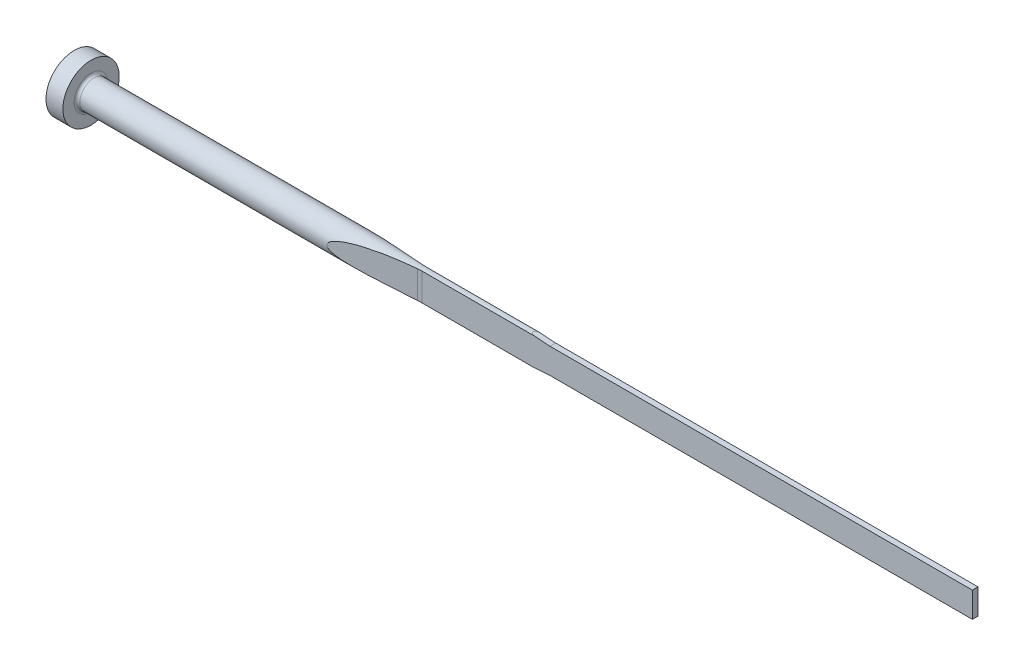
ISO-10303-21;
HEADER;
FILE_DESCRIPTION(('STEP AP214'),'2;1');
FILE_NAME('part.step','',(''),(''),'','','');
FILE_SCHEMA(('AUTOMOTIVE_DESIGN { 1 0 10303 214 1 1 1 1 }'));
ENDSEC;
DATA;
#1=APPLICATION_CONTEXT('core data for automotive mechanical design processes');
#2=APPLICATION_PROTOCOL_DEFINITION('international standard','automotive_design',2000,#1);
#3=PRODUCT_CONTEXT('',#1,'mechanical');
#4=PRODUCT('Part','Part','',(#3));
#5=PRODUCT_RELATED_PRODUCT_CATEGORY('part','',(#4));
#6=PRODUCT_DEFINITION_FORMATION('','',#4);
#7=PRODUCT_DEFINITION_CONTEXT('part definition',#1,'design');
#8=PRODUCT_DEFINITION('design','',#6,#7);
#9=PRODUCT_DEFINITION_SHAPE('','',#8);
#10=(LENGTH_UNIT() NAMED_UNIT(*) SI_UNIT(.MILLI.,.METRE.));
#11=(NAMED_UNIT(*) PLANE_ANGLE_UNIT() SI_UNIT($,.RADIAN.));
#12=(NAMED_UNIT(*) SI_UNIT($,.STERADIAN.) SOLID_ANGLE_UNIT());
#13=UNCERTAINTY_MEASURE_WITH_UNIT(LENGTH_MEASURE(1.E-05),#10,'distance_accuracy_value','');
#14=(GEOMETRIC_REPRESENTATION_CONTEXT(3) GLOBAL_UNCERTAINTY_ASSIGNED_CONTEXT((#13)) GLOBAL_UNIT_ASSIGNED_CONTEXT((#10,
#11,#12)) REPRESENTATION_CONTEXT('',''));
#15=CARTESIAN_POINT('',(0.,0.,0.));
#16=DIRECTION('',(0.,0.,1.));
#17=DIRECTION('',(1.,0.,0.));
#18=AXIS2_PLACEMENT_3D('',#15,#16,#17);
#19=CARTESIAN_POINT('',(0.,0.,0.));
#20=DIRECTION('',(1.,0.,0.));
#21=DIRECTION('',(0.,0.,-1.));
#22=AXIS2_PLACEMENT_3D('',#19,#20,#21);
#23=PLANE('',#22);
#24=CARTESIAN_POINT('',(0.,0.,0.));
#25=DIRECTION('',(-1.,0.,0.));
#26=DIRECTION('',(0.,0.,1.));
#27=AXIS2_PLACEMENT_3D('',#24,#25,#26);
#28=CIRCLE('',#27,5.);
#29=CARTESIAN_POINT('',(0.,0.,5.));
#30=VERTEX_POINT('',#29);
#31=EDGE_CURVE('E121',#30,#30,#28,.T.);
#32=ORIENTED_EDGE('',*,*,#31,.T.);
#33=EDGE_LOOP('',(#32));
#34=FACE_BOUND('',#33,.T.);
#35=ADVANCED_FACE('F16',(#34),#23,.F.);
#36=CARTESIAN_POINT('',(0.,0.,0.));
#37=DIRECTION('',(-1.,0.,0.));
#38=DIRECTION('',(0.,0.,1.));
#39=AXIS2_PLACEMENT_3D('',#36,#37,#38);
#40=CYLINDRICAL_SURFACE('',#39,5.);
#41=ORIENTED_EDGE('',*,*,#31,.F.);
#42=EDGE_LOOP('',(#41));
#43=FACE_BOUND('',#42,.T.);
#44=CARTESIAN_POINT('',(3.,0.,0.));
#45=DIRECTION('',(-1.,0.,0.));
#46=DIRECTION('',(0.,0.,1.));
#47=AXIS2_PLACEMENT_3D('',#44,#45,#46);
#48=CIRCLE('',#47,5.);
#49=CARTESIAN_POINT('',(3.,0.,5.));
#50=VERTEX_POINT('',#49);
#51=EDGE_CURVE('E174',#50,#50,#48,.T.);
#52=ORIENTED_EDGE('',*,*,#51,.T.);
#53=EDGE_LOOP('',(#52));
#54=FACE_BOUND('',#53,.T.);
#55=ADVANCED_FACE('F155',(#43,#54),#40,.T.);
#56=CARTESIAN_POINT('',(3.,5.,0.));
#57=DIRECTION('',(-1.,0.,0.));
#58=DIRECTION('',(0.,0.,1.));
#59=AXIS2_PLACEMENT_3D('',#56,#57,#58);
#60=PLANE('',#59);
#61=CARTESIAN_POINT('',(3.,0.,0.));
#62=DIRECTION('',(-1.,0.,0.));
#63=DIRECTION('',(0.,0.,1.));
#64=AXIS2_PLACEMENT_3D('',#61,#62,#63);
#65=CIRCLE('',#64,3.);
#66=CARTESIAN_POINT('',(3.,0.,3.));
#67=VERTEX_POINT('',#66);
#68=EDGE_CURVE('E24',#67,#67,#65,.T.);
#69=ORIENTED_EDGE('',*,*,#68,.T.);
#70=EDGE_LOOP('',(#69));
#71=FACE_BOUND('',#70,.T.);
#72=ORIENTED_EDGE('',*,*,#51,.F.);
#73=EDGE_LOOP('',(#72));
#74=FACE_BOUND('',#73,.T.);
#75=ADVANCED_FACE('F152',(#71,#74),#60,.F.);
#76=CARTESIAN_POINT('',(0.,0.,0.));
#77=DIRECTION('',(-1.,0.,0.));
#78=DIRECTION('',(0.,0.,1.));
#79=AXIS2_PLACEMENT_3D('',#76,#77,#78);
#80=CYLINDRICAL_SURFACE('',#79,2.5);
#81=CARTESIAN_POINT('',(3.5,0.,0.));
#82=DIRECTION('',(-1.,0.,0.));
#83=DIRECTION('',(0.,0.,1.));
#84=AXIS2_PLACEMENT_3D('',#81,#82,#83);
#85=CIRCLE('',#84,2.5);
#86=CARTESIAN_POINT('',(3.5,0.,2.5));
#87=VERTEX_POINT('',#86);
#88=EDGE_CURVE('E10',#87,#87,#85,.F.);
#89=ORIENTED_EDGE('',*,*,#88,.T.);
#90=EDGE_LOOP('',(#89));
#91=FACE_BOUND('',#90,.T.);
#92=DIRECTION('',(-1.,0.,0.));
#93=VECTOR('',#92,1.);
#94=CARTESIAN_POINT('',(0.,2.44948974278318,0.500000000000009));
#95=LINE('',#94,#93);
#96=CARTESIAN_POINT('',(62.292693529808,2.44948974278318,0.5));
#97=VERTEX_POINT('',#96);
#98=CARTESIAN_POINT('',(82.1042183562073,2.44948974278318,0.500000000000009));
#99=VERTEX_POINT('',#98);
#100=EDGE_CURVE('E185',#97,#99,#95,.F.);
#101=ORIENTED_EDGE('',*,*,#100,.T.);
#102=CARTESIAN_POINT('',(102.097464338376,2.5,0.));
#103=CARTESIAN_POINT('',(102.097461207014,2.49999972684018,0.0148287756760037));
#104=CARTESIAN_POINT('',(102.095907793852,2.49986588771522,0.029668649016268));
#105=CARTESIAN_POINT('',(102.089939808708,2.49935203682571,0.0587629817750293));
#106=CARTESIAN_POINT('',(102.085518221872,2.49897142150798,0.0730159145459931));
#107=CARTESIAN_POINT('',(102.073032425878,2.49789773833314,0.10393090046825));
#108=CARTESIAN_POINT('',(102.064342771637,2.49715110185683,0.120332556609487));
#109=CARTESIAN_POINT('',(102.044523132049,2.49545100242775,0.151557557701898));
#110=CARTESIAN_POINT('',(102.033387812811,2.49449708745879,0.166377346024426));
#111=CARTESIAN_POINT('',(101.999200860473,2.49157415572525,0.206782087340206));
#112=CARTESIAN_POINT('',(101.974151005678,2.48943888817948,0.230635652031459));
#113=CARTESIAN_POINT('',(101.921196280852,2.48494403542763,0.274848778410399));
#114=CARTESIAN_POINT('',(101.893282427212,2.48258374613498,0.295196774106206));
#115=CARTESIAN_POINT('',(101.814706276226,2.47596945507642,0.347423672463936));
#116=CARTESIAN_POINT('',(101.762401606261,2.47159848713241,0.376787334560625));
#117=CARTESIAN_POINT('',(101.655432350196,2.46273386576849,0.430903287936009));
#118=CARTESIAN_POINT('',(101.600761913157,2.45823991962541,0.455643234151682));
#119=CARTESIAN_POINT('',(101.489776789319,2.44919559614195,0.501997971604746));
#120=CARTESIAN_POINT('',(101.433454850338,2.44464504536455,0.52359527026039));
#121=CARTESIAN_POINT('',(101.320029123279,2.43556276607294,0.564325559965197));
#122=CARTESIAN_POINT('',(101.262926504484,2.43103102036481,0.583461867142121));
#123=CARTESIAN_POINT('',(101.068857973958,2.41577124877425,0.645038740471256));
#124=CARTESIAN_POINT('',(100.930520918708,2.40513024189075,0.683160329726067));
#125=CARTESIAN_POINT('',(100.6521648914,2.38421133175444,0.752878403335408));
#126=CARTESIAN_POINT('',(100.5121448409,2.37393368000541,0.784470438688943));
#127=CARTESIAN_POINT('',(100.230762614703,2.35378007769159,0.843019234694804));
#128=CARTESIAN_POINT('',(100.089398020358,2.343905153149,0.869964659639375));
#129=CARTESIAN_POINT('',(99.8060514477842,2.32461904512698,0.92025371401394));
#130=CARTESIAN_POINT('',(99.6640696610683,2.31520772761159,0.943598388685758));
#131=CARTESIAN_POINT('',(99.3795601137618,2.29685883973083,0.987422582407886));
#132=CARTESIAN_POINT('',(99.2370321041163,2.28792152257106,1.00790057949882));
#133=CARTESIAN_POINT('',(98.9516166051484,2.27053704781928,1.04647413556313));
#134=CARTESIAN_POINT('',(98.8087290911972,2.26208992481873,1.06456952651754));
#135=CARTESIAN_POINT('',(98.5229015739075,2.24570665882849,1.09870807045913));
#136=CARTESIAN_POINT('',(98.379961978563,2.23776976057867,1.11475429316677));
#137=CARTESIAN_POINT('',(98.0938743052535,2.22239856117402,1.14509051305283));
#138=CARTESIAN_POINT('',(97.9507262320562,2.21496424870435,1.15938054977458));
#139=CARTESIAN_POINT('',(97.5213556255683,2.19343744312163,1.19990677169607));
#140=CARTESIAN_POINT('',(97.234875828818,2.18010210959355,1.22383750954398));
#141=CARTESIAN_POINT('',(96.661451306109,2.15547247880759,1.26670319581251));
#142=CARTESIAN_POINT('',(96.3745065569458,2.14417828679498,1.28563788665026));
#143=CARTESIAN_POINT('',(95.5130838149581,2.11337270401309,1.33613542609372));
#144=CARTESIAN_POINT('',(94.9381186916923,2.09694339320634,1.3613828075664));
#145=CARTESIAN_POINT('',(93.7863687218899,2.07232685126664,1.39854209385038));
#146=CARTESIAN_POINT('',(93.2095826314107,2.06415755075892,1.41042499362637));
#147=CARTESIAN_POINT('',(92.05593055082,2.05613989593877,1.42209136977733));
#148=CARTESIAN_POINT('',(91.4790645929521,2.05629006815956,1.42187698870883));
#149=CARTESIAN_POINT('',(90.326886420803,2.06489725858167,1.40934448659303));
#150=CARTESIAN_POINT('',(89.7515737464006,2.07333471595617,1.39705486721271));
#151=CARTESIAN_POINT('',(88.6013398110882,2.09847559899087,1.35902907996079));
#152=CARTESIAN_POINT('',(88.0264187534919,2.11518187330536,1.33328827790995));
#153=CARTESIAN_POINT('',(87.1657059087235,2.14637820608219,1.28196608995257));
#154=CARTESIAN_POINT('',(86.8794156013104,2.15778279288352,1.26277022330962));
#155=CARTESIAN_POINT('',(86.3073095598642,2.18262320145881,1.21934093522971));
#156=CARTESIAN_POINT('',(86.0214938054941,2.19605893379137,1.19510773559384));
#157=CARTESIAN_POINT('',(85.4507084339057,2.22493329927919,1.14044951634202));
#158=CARTESIAN_POINT('',(85.1657384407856,2.24037083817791,1.11002787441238));
#159=CARTESIAN_POINT('',(84.59690093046,2.2732166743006,1.04114105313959));
#160=CARTESIAN_POINT('',(84.3130332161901,2.29062460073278,1.00267738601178));
#161=CARTESIAN_POINT('',(83.889127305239,2.31812504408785,0.936403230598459));
#162=CARTESIAN_POINT('',(83.7483668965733,2.32750703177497,0.912926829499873));
#163=CARTESIAN_POINT('',(83.4674561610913,2.34672593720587,0.86233263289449));
#164=CARTESIAN_POINT('',(83.3273061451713,2.35656306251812,0.835213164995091));
#165=CARTESIAN_POINT('',(83.0483966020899,2.3766290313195,0.776274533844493));
#166=CARTESIAN_POINT('',(82.9096343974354,2.38685678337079,0.744467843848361));
#167=CARTESIAN_POINT('',(82.6338958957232,2.40765844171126,0.674201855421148));
#168=CARTESIAN_POINT('',(82.4969182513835,2.41823206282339,0.635747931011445));
#169=CARTESIAN_POINT('',(82.2686547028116,2.43623923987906,0.561875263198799));
#170=CARTESIAN_POINT('',(82.1764871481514,2.4436197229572,0.529273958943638));
#171=CARTESIAN_POINT('',(82.0404853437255,2.45466382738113,0.474309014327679));
#172=CARTESIAN_POINT('',(81.9954512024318,2.45834703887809,0.45493849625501));
#173=CARTESIAN_POINT('',(81.9066552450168,2.46565874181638,0.413489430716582));
#174=CARTESIAN_POINT('',(81.8628922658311,2.46928728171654,0.391413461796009));
#175=CARTESIAN_POINT('',(81.7770474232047,2.47645042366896,0.343214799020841));
#176=CARTESIAN_POINT('',(81.7349876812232,2.47998366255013,0.31705253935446));
#177=CARTESIAN_POINT('',(81.655089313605,2.48673536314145,0.258883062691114));
#178=CARTESIAN_POINT('',(81.6172203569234,2.48995606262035,0.226922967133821));
#179=CARTESIAN_POINT('',(81.5719982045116,2.49381916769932,0.17622488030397));
#180=CARTESIAN_POINT('',(81.5602517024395,2.49482469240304,0.161525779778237));
#181=CARTESIAN_POINT('',(81.5390869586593,2.49663900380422,0.130519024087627));
#182=CARTESIAN_POINT('',(81.5296627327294,2.4974482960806,0.114215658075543));
#183=CARTESIAN_POINT('',(81.516547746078,2.49857559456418,0.0852149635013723));
#184=CARTESIAN_POINT('',(81.5119849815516,2.49896815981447,0.0729199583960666));
#185=CARTESIAN_POINT('',(81.5049266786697,2.4995756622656,0.0477434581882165));
#186=CARTESIAN_POINT('',(81.502428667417,2.49979081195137,0.0348626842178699));
#187=CARTESIAN_POINT('',(81.4997825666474,2.50001872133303,0.00877940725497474));
#188=CARTESIAN_POINT('',(81.4996476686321,2.50003034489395,-0.00442449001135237));
#189=CARTESIAN_POINT('',(81.5017793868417,2.49984673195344,-0.0306357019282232));
#190=CARTESIAN_POINT('',(81.5040475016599,2.49965136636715,-0.0436428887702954));
#191=CARTESIAN_POINT('',(81.5112740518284,2.49902932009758,-0.0712313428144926));
#192=CARTESIAN_POINT('',(81.5166218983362,2.49856916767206,-0.0857078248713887));
#193=CARTESIAN_POINT('',(81.5295657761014,2.4974566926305,-0.113605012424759));
#194=CARTESIAN_POINT('',(81.5371663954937,2.49680397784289,-0.12702349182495));
#195=CARTESIAN_POINT('',(81.5595648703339,2.49488318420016,-0.161306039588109));
#196=CARTESIAN_POINT('',(81.5757950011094,2.49349390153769,-0.18121359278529));
#197=CARTESIAN_POINT('',(81.6108632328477,2.49050063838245,-0.218534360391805));
#198=CARTESIAN_POINT('',(81.6297090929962,2.4888960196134,-0.235939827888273));
#199=CARTESIAN_POINT('',(81.6783514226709,2.48476718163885,-0.276640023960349));
#200=CARTESIAN_POINT('',(81.7090872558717,2.48216907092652,-0.298789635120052));
#201=CARTESIAN_POINT('',(81.7724829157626,2.47683663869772,-0.340164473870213));
#202=CARTESIAN_POINT('',(81.8051470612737,2.47410201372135,-0.359382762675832));
#203=CARTESIAN_POINT('',(81.8718387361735,2.46854725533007,-0.395745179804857));
#204=CARTESIAN_POINT('',(81.9058730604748,2.46572671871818,-0.412876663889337));
#205=CARTESIAN_POINT('',(81.9746882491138,2.46005410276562,-0.445425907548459));
#206=CARTESIAN_POINT('',(82.009468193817,2.45720206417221,-0.460845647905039));
#207=CARTESIAN_POINT('',(82.1192344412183,2.44825016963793,-0.507059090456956));
#208=CARTESIAN_POINT('',(82.1952001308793,2.44212565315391,-0.535513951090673));
#209=CARTESIAN_POINT('',(82.3485291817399,2.42991400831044,-0.588420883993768));
#210=CARTESIAN_POINT('',(82.4258935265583,2.42382691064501,-0.612870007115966));
#211=CARTESIAN_POINT('',(82.6596296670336,2.40566775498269,-0.681961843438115));
#212=CARTESIAN_POINT('',(82.8173007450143,2.39372593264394,-0.722218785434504));
#213=CARTESIAN_POINT('',(83.134400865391,2.37034748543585,-0.795544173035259));
#214=CARTESIAN_POINT('',(83.2938313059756,2.35891130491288,-0.828606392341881));
#215=CARTESIAN_POINT('',(83.6134752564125,2.33662896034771,-0.889503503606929));
#216=CARTESIAN_POINT('',(83.7736872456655,2.32578194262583,-0.9173461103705));
#217=CARTESIAN_POINT('',(84.093475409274,2.30477860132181,-0.968895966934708));
#218=CARTESIAN_POINT('',(84.2530462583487,2.29461740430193,-0.992634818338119));
#219=CARTESIAN_POINT('',(84.5726600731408,2.27490808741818,-1.03700475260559));
#220=CARTESIAN_POINT('',(84.7327030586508,2.26535999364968,-1.05763570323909));
#221=CARTESIAN_POINT('',(85.2134140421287,2.23765005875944,-1.11569856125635));
#222=CARTESIAN_POINT('',(85.5346002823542,2.22042675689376,-1.14929069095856));
#223=CARTESIAN_POINT('',(86.1782138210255,2.18851482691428,-1.20893619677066));
#224=CARTESIAN_POINT('',(86.5006422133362,2.17382967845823,-1.23497925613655));
#225=CARTESIAN_POINT('',(87.1459990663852,2.14704912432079,-1.28097113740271));
#226=CARTESIAN_POINT('',(87.4689274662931,2.13495342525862,-1.30092064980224));
#227=CARTESIAN_POINT('',(88.1147712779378,2.11337720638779,-1.33568452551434));
#228=CARTESIAN_POINT('',(88.4376862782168,2.10389369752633,-1.35050476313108));
#229=CARTESIAN_POINT('',(89.0837613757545,2.08753182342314,-1.37565592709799));
#230=CARTESIAN_POINT('',(89.4069214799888,2.0806535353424,-1.38598672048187));
#231=CARTESIAN_POINT('',(90.3762141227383,2.06394268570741,-1.41088029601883));
#232=CARTESIAN_POINT('',(91.0225852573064,2.05801989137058,-1.41936594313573));
#233=CARTESIAN_POINT('',(92.1039347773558,2.05684991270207,-1.42103464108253));
#234=CARTESIAN_POINT('',(92.5389158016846,2.05874489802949,-1.41831460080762));
#235=CARTESIAN_POINT('',(93.4088005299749,2.06726379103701,-1.40587595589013));
#236=CARTESIAN_POINT('',(93.8437042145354,2.07388836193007,-1.39615636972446));
#237=CARTESIAN_POINT('',(94.7129411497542,2.09185425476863,-1.36909017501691));
#238=CARTESIAN_POINT('',(95.1472745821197,2.1031930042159,-1.3517477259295));
#239=CARTESIAN_POINT('',(96.0153218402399,2.13056908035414,-1.30818810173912));
#240=CARTESIAN_POINT('',(96.4490357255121,2.14660592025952,-1.28197184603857));
#241=CARTESIAN_POINT('',(97.1745507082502,2.17736801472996,-1.22868635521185));
#242=CARTESIAN_POINT('',(97.4666298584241,2.19082352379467,-1.20466759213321));
#243=CARTESIAN_POINT('',(98.0501123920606,2.21983741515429,-1.15034198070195));
#244=CARTESIAN_POINT('',(98.3415157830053,2.23539577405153,-1.12003520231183));
#245=CARTESIAN_POINT('',(98.829448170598,2.26322710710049,-1.06229208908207));
#246=CARTESIAN_POINT('',(99.026271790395,2.27494184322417,-1.03708116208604));
#247=CARTESIAN_POINT('',(99.4192067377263,2.29929823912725,-0.981910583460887));
#248=CARTESIAN_POINT('',(99.6153180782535,2.31193988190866,-0.951951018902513));
#249=CARTESIAN_POINT('',(99.9438218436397,2.33392232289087,-0.89631842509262));
#250=CARTESIAN_POINT('',(100.07651681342,2.34302444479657,-0.872342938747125));
#251=CARTESIAN_POINT('',(100.341153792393,2.36161713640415,-0.820686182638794));
#252=CARTESIAN_POINT('',(100.473095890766,2.37110765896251,-0.793005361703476));
#253=CARTESIAN_POINT('',(100.694215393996,2.38737745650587,-0.742222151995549));
#254=CARTESIAN_POINT('',(100.783702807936,2.39406350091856,-0.720446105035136));
#255=CARTESIAN_POINT('',(100.961886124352,2.40757595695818,-0.673920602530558));
#256=CARTESIAN_POINT('',(101.050582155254,2.41440234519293,-0.649171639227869));
#257=CARTESIAN_POINT('',(101.199320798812,2.42601435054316,-0.604000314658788));
#258=CARTESIAN_POINT('',(101.259681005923,2.43077315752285,-0.584632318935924));
#259=CARTESIAN_POINT('',(101.379492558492,2.440309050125,-0.543444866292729));
#260=CARTESIAN_POINT('',(101.438944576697,2.44508611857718,-0.521627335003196));
#261=CARTESIAN_POINT('',(101.579687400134,2.45649952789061,-0.465575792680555));
#262=CARTESIAN_POINT('',(101.660424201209,2.4631322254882,-0.429823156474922));
#263=CARTESIAN_POINT('',(101.779763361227,2.47305086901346,-0.366735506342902));
#264=CARTESIAN_POINT('',(101.820399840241,2.47645024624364,-0.34329285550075));
#265=CARTESIAN_POINT('',(101.898729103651,2.48304089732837,-0.291882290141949));
#266=CARTESIAN_POINT('',(101.936432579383,2.48623291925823,-0.26393207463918));
#267=CARTESIAN_POINT('',(101.984811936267,2.49034868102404,-0.219815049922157));
#268=CARTESIAN_POINT('',(101.998147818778,2.49148569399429,-0.206620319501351));
#269=CARTESIAN_POINT('',(102.023318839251,2.49363556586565,-0.178822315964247));
#270=CARTESIAN_POINT('',(102.035153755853,2.49464840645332,-0.164218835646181));
#271=CARTESIAN_POINT('',(102.055020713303,2.49635111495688,-0.135662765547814));
#272=CARTESIAN_POINT('',(102.063355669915,2.49706654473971,-0.121926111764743));
#273=CARTESIAN_POINT('',(102.077710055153,2.49829978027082,-0.0932837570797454));
#274=CARTESIAN_POINT('',(102.0837357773,2.49881812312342,-0.0783813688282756));
#275=CARTESIAN_POINT('',(102.09123159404,2.49946323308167,-0.0528042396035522));
#276=CARTESIAN_POINT('',(102.093551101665,2.49966296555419,-0.0423803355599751));
#277=CARTESIAN_POINT('',(102.096668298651,2.4999314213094,-0.0213061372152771));
#278=CARTESIAN_POINT('',(102.097466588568,2.5000001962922,-0.0106559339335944));
#279=CARTESIAN_POINT('',(102.097464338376,2.5,0.));
#280=B_SPLINE_CURVE_WITH_KNOTS('',3,(#102,#103,#104,#105,#106,#107,#108,#109,#110,#111,#112,
#113,#114,#115,#116,#117,#118,#119,#120,#121,#122,#123,#124,#125,#126,#127,#128,#129,#130,#131,
#132,#133,#134,#135,#136,#137,#138,#139,#140,#141,#142,#143,#144,#145,#146,#147,#148,#149,#150,
#151,#152,#153,#154,#155,#156,#157,#158,#159,#160,#161,#162,#163,#164,#165,#166,#167,#168,#169,
#170,#171,#172,#173,#174,#175,#176,#177,#178,#179,#180,#181,#182,#183,#184,#185,#186,#187,#188,
#189,#190,#191,#192,#193,#194,#195,#196,#197,#198,#199,#200,#201,#202,#203,#204,#205,#206,#207,
#208,#209,#210,#211,#212,#213,#214,#215,#216,#217,#218,#219,#220,#221,#222,#223,#224,#225,#226,
#227,#228,#229,#230,#231,#232,#233,#234,#235,#236,#237,#238,#239,#240,#241,#242,#243,#244,#245,
#246,#247,#248,#249,#250,#251,#252,#253,#254,#255,#256,#257,#258,#259,#260,#261,#262,#263,#264,
#265,#266,#267,#268,#269,#270,#271,#272,#273,#274,#275,#276,#277,#278,#279),.UNSPECIFIED.,.T.,
.F.,(4,2,2,2,2,2,2,2,2,2,2,2,2,2,2,2,2,2,2,2,2,2,2,2,2,2,2,2,2,2,2,2,2,2,2,2,2,2,2,2,2,2,2,2,2,
2,2,2,2,2,2,2,2,2,2,2,2,2,2,2,2,2,2,2,2,2,2,2,2,2,2,2,2,2,2,2,2,2,2,2,2,2,2,2,2,2,2,2,4),(0.,
0.0444319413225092,0.088972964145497,0.144378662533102,0.199906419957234,0.303296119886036,
0.407020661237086,0.586971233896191,0.767395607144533,0.948788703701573,1.12993475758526,
1.56128114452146,1.99292047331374,2.42559835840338,2.85815040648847,3.29093123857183,
3.7237425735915,4.15589774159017,4.58804317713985,5.45133337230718,6.31466806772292,
8.04164295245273,9.77235871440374,11.5027679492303,13.2291026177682,14.9560324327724,
15.8174726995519,16.6788750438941,17.5398084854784,18.4005801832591,18.8295837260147,
19.2587848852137,19.6868638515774,20.1145983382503,20.4084487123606,20.5558793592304,
20.7031705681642,20.851988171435,20.9996464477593,21.056030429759,21.1122675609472,
21.151481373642,21.1906481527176,21.230033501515,21.2694434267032,21.3155039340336,
21.3616589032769,21.4383904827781,21.5153547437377,21.6289881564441,21.7428865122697,
21.8574438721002,21.9718672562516,22.2157179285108,22.4597473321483,22.9489090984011,
23.4384925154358,23.9273465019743,24.4122497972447,24.8971737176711,25.8672154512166,
26.8385766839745,27.8098278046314,28.7799628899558,29.7501267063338,31.6891736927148,
32.994088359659,34.2991860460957,35.6035724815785,36.9078238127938,37.7878902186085,
38.6679468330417,39.2642363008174,39.8605148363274,40.2659291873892,40.6712944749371,
40.948281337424,41.2252224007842,41.4158799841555,41.6063887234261,41.8714163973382,
42.0123992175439,42.1528413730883,42.2091471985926,42.2654613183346,42.3135585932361,
42.3615238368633,42.3934651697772,42.4253938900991),.UNSPECIFIED.);
#281=CARTESIAN_POINT('',(82.1042183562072,2.44948974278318,-0.49999999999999));
#282=VERTEX_POINT('',#281);
#283=EDGE_CURVE('E206',#99,#282,#280,.T.);
#284=ORIENTED_EDGE('',*,*,#283,.T.);
#285=DIRECTION('',(-1.,0.,0.));
#286=VECTOR('',#285,1.);
#287=CARTESIAN_POINT('',(0.,2.44948974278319,-0.499999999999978));
#288=LINE('',#287,#286);
#289=CARTESIAN_POINT('',(62.292693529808,2.44948974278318,-0.499999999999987));
#290=VERTEX_POINT('',#289);
#291=EDGE_CURVE('E176',#282,#290,#288,.T.);
#292=ORIENTED_EDGE('',*,*,#291,.T.);
#293=CARTESIAN_POINT('',(62.292693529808,-2.44948974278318,-0.5));
#294=CARTESIAN_POINT('',(62.5588866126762,-2.44949372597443,-0.500000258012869));
#295=CARTESIAN_POINT('',(62.825091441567,-2.4473891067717,-0.510633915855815));
#296=CARTESIAN_POINT('',(63.3559334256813,-2.43814355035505,-0.55311919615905));
#297=CARTESIAN_POINT('',(63.6205694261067,-2.43099927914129,-0.584984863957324));
#298=CARTESIAN_POINT('',(64.0145441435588,-2.41453016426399,-0.648455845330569));
#299=CARTESIAN_POINT('',(64.1453119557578,-2.4080860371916,-0.672210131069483));
#300=CARTESIAN_POINT('',(64.40565544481,-2.39276243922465,-0.724877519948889));
#301=CARTESIAN_POINT('',(64.5352312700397,-2.38388327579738,-0.753789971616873));
#302=CARTESIAN_POINT('',(64.7928017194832,-2.36308190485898,-0.816662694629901));
#303=CARTESIAN_POINT('',(64.9207974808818,-2.35116203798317,-0.850619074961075));
#304=CARTESIAN_POINT('',(65.1749451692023,-2.32351853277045,-0.923461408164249));
#305=CARTESIAN_POINT('',(65.3010974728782,-2.30779568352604,-0.96234633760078));
#306=CARTESIAN_POINT('',(65.5312166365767,-2.27451396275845,-1.03827623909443));
#307=CARTESIAN_POINT('',(65.6355130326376,-2.25764781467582,-1.0746256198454));
#308=CARTESIAN_POINT('',(65.8422110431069,-2.21993972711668,-1.15050579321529));
#309=CARTESIAN_POINT('',(65.9446128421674,-2.1990981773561,-1.19003627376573));
#310=CARTESIAN_POINT('',(66.1473207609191,-2.15266019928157,-1.27211706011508));
#311=CARTESIAN_POINT('',(66.2476231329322,-2.12705596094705,-1.31467225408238));
#312=CARTESIAN_POINT('',(66.4454743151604,-2.07025945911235,-1.40241134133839));
#313=CARTESIAN_POINT('',(66.5430231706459,-2.03906728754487,-1.44759519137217));
#314=CARTESIAN_POINT('',(66.7361904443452,-1.96959929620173,-1.54081458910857));
#315=CARTESIAN_POINT('',(66.8317577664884,-1.93122399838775,-1.58888280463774));
#316=CARTESIAN_POINT('',(67.0185974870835,-1.84654718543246,-1.6865476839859));
#317=CARTESIAN_POINT('',(67.1098682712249,-1.80024272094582,-1.73614491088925));
#318=CARTESIAN_POINT('',(67.2865303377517,-1.69870479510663,-1.83560065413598));
#319=CARTESIAN_POINT('',(67.3719465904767,-1.64351311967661,-1.88545693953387));
#320=CARTESIAN_POINT('',(67.5357461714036,-1.52288238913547,-1.98416054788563));
#321=CARTESIAN_POINT('',(67.6141385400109,-1.45745681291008,-2.03300910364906));
#322=CARTESIAN_POINT('',(67.7594874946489,-1.31768304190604,-2.12615039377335));
#323=CARTESIAN_POINT('',(67.8267439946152,-1.24371763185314,-2.17054190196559));
#324=CARTESIAN_POINT('',(67.9506730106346,-1.08468700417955,-2.25422157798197));
#325=CARTESIAN_POINT('',(68.007346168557,-0.999622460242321,-2.29351005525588));
#326=CARTESIAN_POINT('',(68.107947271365,-0.81782659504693,-2.36448089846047));
#327=CARTESIAN_POINT('',(68.1517275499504,-0.720976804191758,-2.39607447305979));
#328=CARTESIAN_POINT('',(68.2226979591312,-0.518512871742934,-2.4478563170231));
#329=CARTESIAN_POINT('',(68.2499117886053,-0.412911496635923,-2.4680608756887));
#330=CARTESIAN_POINT('',(68.2831489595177,-0.211424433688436,-2.49282746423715));
#331=CARTESIAN_POINT('',(68.2915283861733,-0.116140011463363,-2.49912663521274));
#332=CARTESIAN_POINT('',(68.2936293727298,0.0746705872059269,-2.50070139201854));
#333=CARTESIAN_POINT('',(68.2873571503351,0.17019664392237,-2.49598165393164));
#334=CARTESIAN_POINT('',(68.2621053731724,0.347671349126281,-2.47713758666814));
#335=CARTESIAN_POINT('',(68.2446016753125,0.429956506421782,-2.46410646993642));
#336=CARTESIAN_POINT('',(68.1992944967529,0.590050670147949,-2.43074647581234));
#337=CARTESIAN_POINT('',(68.1714903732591,0.66785939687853,-2.41041714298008));
#338=CARTESIAN_POINT('',(68.1045463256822,0.82290580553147,-2.36217650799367));
#339=CARTESIAN_POINT('',(68.0647488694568,0.899721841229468,-2.33383391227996));
#340=CARTESIAN_POINT('',(67.9764054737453,1.04588111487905,-2.27210021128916));
#341=CARTESIAN_POINT('',(67.9278546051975,1.11522010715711,-2.23870626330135));
#342=CARTESIAN_POINT('',(67.7911598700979,1.28688158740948,-2.14672825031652));
#343=CARTESIAN_POINT('',(67.6971222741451,1.38302315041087,-2.08535584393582));
#344=CARTESIAN_POINT('',(67.495283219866,1.55679658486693,-1.95907986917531));
#345=CARTESIAN_POINT('',(67.3874453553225,1.63437788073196,-1.89416723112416));
#346=CARTESIAN_POINT('',(67.1840639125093,1.75983401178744,-1.77730161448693));
#347=CARTESIAN_POINT('',(67.0902568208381,1.81055086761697,-1.72530367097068));
#348=CARTESIAN_POINT('',(66.8975860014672,1.90307712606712,-1.62267588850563));
#349=CARTESIAN_POINT('',(66.7987190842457,1.94488082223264,-1.57204694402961));
#350=CARTESIAN_POINT('',(66.5968702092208,2.02093418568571,-1.47300007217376));
#351=CARTESIAN_POINT('',(66.4938819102,2.05517163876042,-1.4245858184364));
#352=CARTESIAN_POINT('',(66.2846842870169,2.11720601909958,-1.33063915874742));
#353=CARTESIAN_POINT('',(66.1784737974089,2.14500058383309,-1.2851078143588));
#354=CARTESIAN_POINT('',(65.8796243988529,2.21476662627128,-1.1631613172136));
#355=CARTESIAN_POINT('',(65.6841449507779,2.25090239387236,-1.09033535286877));
#356=CARTESIAN_POINT('',(65.2872785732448,2.31090016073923,-0.956603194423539));
#357=CARTESIAN_POINT('',(65.0858872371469,2.33475274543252,-0.895706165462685));
#358=CARTESIAN_POINT('',(64.6786654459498,2.37376110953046,-0.78652368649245));
#359=CARTESIAN_POINT('',(64.4728301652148,2.38890688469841,-0.73825277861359));
#360=CARTESIAN_POINT('',(64.0582447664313,2.41310778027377,-0.654821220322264));
#361=CARTESIAN_POINT('',(63.8494953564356,2.42216435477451,-0.619657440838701));
#362=CARTESIAN_POINT('',(63.4135751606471,2.43658861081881,-0.560395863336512));
#363=CARTESIAN_POINT('',(63.1862451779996,2.44161072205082,-0.537384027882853));
#364=CARTESIAN_POINT('',(62.7304720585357,2.44810417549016,-0.506976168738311));
#365=CARTESIAN_POINT('',(62.5020287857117,2.44957507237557,-0.499582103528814));
#366=CARTESIAN_POINT('',(62.0451221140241,2.44939695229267,-0.50045444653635));
#367=CARTESIAN_POINT('',(61.8166587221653,2.44774723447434,-0.508724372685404));
#368=CARTESIAN_POINT('',(61.3609108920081,2.44084338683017,-0.540885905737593));
#369=CARTESIAN_POINT('',(61.1336262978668,2.4355897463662,-0.564775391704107));
#370=CARTESIAN_POINT('',(60.7028933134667,2.42078725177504,-0.625020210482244));
#371=CARTESIAN_POINT('',(60.4992329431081,2.41169418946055,-0.659974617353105));
#372=CARTESIAN_POINT('',(60.094733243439,2.3876247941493,-0.742358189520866));
#373=CARTESIAN_POINT('',(59.8938945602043,2.37264713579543,-0.789790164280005));
#374=CARTESIAN_POINT('',(59.4967315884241,2.33436839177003,-0.896627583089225));
#375=CARTESIAN_POINT('',(59.300397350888,2.31108801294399,-0.956003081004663));
#376=CARTESIAN_POINT('',(58.9133935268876,2.25289189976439,-1.08607609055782));
#377=CARTESIAN_POINT('',(58.7227196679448,2.21798519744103,-1.15676479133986));
#378=CARTESIAN_POINT('',(58.3572451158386,2.13403355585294,-1.30493095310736));
#379=CARTESIAN_POINT('',(58.1821154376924,2.08568345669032,-1.38196893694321));
#380=CARTESIAN_POINT('',(57.9269277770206,1.99848366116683,-1.50283408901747));
#381=CARTESIAN_POINT('',(57.8430974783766,1.96696212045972,-1.54401751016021));
#382=CARTESIAN_POINT('',(57.6784730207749,1.89828457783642,-1.62771198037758));
#383=CARTESIAN_POINT('',(57.5976783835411,1.86112946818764,-1.67022281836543));
#384=CARTESIAN_POINT('',(57.3881762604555,1.75404290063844,-1.7840555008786));
#385=CARTESIAN_POINT('',(57.2625974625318,1.67854198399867,-1.85608051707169));
#386=CARTESIAN_POINT('',(57.025727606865,1.5063217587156,-1.99835110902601));
#387=CARTESIAN_POINT('',(56.9144053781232,1.40965003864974,-2.06860028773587));
#388=CARTESIAN_POINT('',(56.7457866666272,1.22841354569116,-2.17903734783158));
#389=CARTESIAN_POINT('',(56.682831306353,1.15050386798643,-2.22145636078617));
#390=CARTESIAN_POINT('',(56.5684532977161,0.983801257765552,-2.30012983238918));
#391=CARTESIAN_POINT('',(56.5170166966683,0.895021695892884,-2.33639173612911));
#392=CARTESIAN_POINT('',(56.4353335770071,0.722259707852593,-2.39484925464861));
#393=CARTESIAN_POINT('',(56.4030302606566,0.639702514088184,-2.41835829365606));
#394=CARTESIAN_POINT('',(56.3501512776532,0.469045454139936,-2.45715993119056));
#395=CARTESIAN_POINT('',(56.3295698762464,0.380948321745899,-2.47245654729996));
#396=CARTESIAN_POINT('',(56.3012835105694,0.201146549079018,-2.49354442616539));
#397=CARTESIAN_POINT('',(56.2936373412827,0.109427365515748,-2.49929228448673));
#398=CARTESIAN_POINT('',(56.2919151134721,-0.0742075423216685,-2.50058367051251));
#399=CARTESIAN_POINT('',(56.2978371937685,-0.166123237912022,-2.49612859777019));
#400=CARTESIAN_POINT('',(56.3218864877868,-0.340173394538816,-2.47817628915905));
#401=CARTESIAN_POINT('',(56.3390502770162,-0.422519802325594,-2.4653931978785));
#402=CARTESIAN_POINT('',(56.383701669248,-0.582793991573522,-2.4324986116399));
#403=CARTESIAN_POINT('',(56.4111906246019,-0.66072119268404,-2.4123861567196));
#404=CARTESIAN_POINT('',(56.4774623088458,-0.815931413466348,-2.36459266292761));
#405=CARTESIAN_POINT('',(56.5168890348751,-0.892805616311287,-2.33648795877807));
#406=CARTESIAN_POINT('',(56.6045048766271,-1.03912590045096,-2.27519726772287));
#407=CARTESIAN_POINT('',(56.6526988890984,-1.1085677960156,-2.24200844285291));
#408=CARTESIAN_POINT('',(56.7882363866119,-1.28022530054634,-2.15068592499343));
#409=CARTESIAN_POINT('',(56.8814321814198,-1.37634140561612,-2.08976116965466));
#410=CARTESIAN_POINT('',(57.0815589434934,-1.55018475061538,-1.96430406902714));
#411=CARTESIAN_POINT('',(57.1885252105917,-1.62786321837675,-1.89976270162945));
#412=CARTESIAN_POINT('',(57.3901520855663,-1.75345310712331,-1.78358664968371));
#413=CARTESIAN_POINT('',(57.4830643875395,-1.80421337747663,-1.7319230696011));
#414=CARTESIAN_POINT('',(57.6739290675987,-1.89689001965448,-1.62989692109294));
#415=CARTESIAN_POINT('',(57.7718846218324,-1.93880073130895,-1.5795352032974));
#416=CARTESIAN_POINT('',(57.9719300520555,-2.01512133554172,-1.48093866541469));
#417=CARTESIAN_POINT('',(58.0740274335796,-2.04951681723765,-1.43270807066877));
#418=CARTESIAN_POINT('',(58.2814397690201,-2.11188903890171,-1.33906055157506));
#419=CARTESIAN_POINT('',(58.3867558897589,-2.13986341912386,-1.29364466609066));
#420=CARTESIAN_POINT('',(58.6832783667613,-2.21018082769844,-1.17186012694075));
#421=CARTESIAN_POINT('',(58.877330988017,-2.24668424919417,-1.09901688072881));
#422=CARTESIAN_POINT('',(59.2713664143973,-2.30738748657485,-0.96506417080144));
#423=CARTESIAN_POINT('',(59.4713539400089,-2.33157721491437,-0.903964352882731));
#424=CARTESIAN_POINT('',(59.8755160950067,-2.37118590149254,-0.794275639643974));
#425=CARTESIAN_POINT('',(60.0796899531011,-2.38660646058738,-0.745684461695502));
#426=CARTESIAN_POINT('',(60.4909298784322,-2.41131636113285,-0.661417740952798));
#427=CARTESIAN_POINT('',(60.6979946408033,-2.42060838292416,-0.625736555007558));
#428=CARTESIAN_POINT('',(61.1355357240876,-2.43566691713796,-0.564474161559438));
#429=CARTESIAN_POINT('',(61.3662271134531,-2.44097184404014,-0.540311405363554));
#430=CARTESIAN_POINT('',(61.8288403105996,-2.44788206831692,-0.508071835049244));
#431=CARTESIAN_POINT('',(62.0607624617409,-2.44948627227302,-0.499999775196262));
#432=CARTESIAN_POINT('',(62.292693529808,-2.44948974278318,-0.5));
#433=B_SPLINE_CURVE_WITH_KNOTS('',3,(#293,#294,#295,#296,#297,#298,#299,#300,#301,#302,#303,
#304,#305,#306,#307,#308,#309,#310,#311,#312,#313,#314,#315,#316,#317,#318,#319,#320,#321,#322,
#323,#324,#325,#326,#327,#328,#329,#330,#331,#332,#333,#334,#335,#336,#337,#338,#339,#340,#341,
#342,#343,#344,#345,#346,#347,#348,#349,#350,#351,#352,#353,#354,#355,#356,#357,#358,#359,#360,
#361,#362,#363,#364,#365,#366,#367,#368,#369,#370,#371,#372,#373,#374,#375,#376,#377,#378,#379,
#380,#381,#382,#383,#384,#385,#386,#387,#388,#389,#390,#391,#392,#393,#394,#395,#396,#397,#398,
#399,#400,#401,#402,#403,#404,#405,#406,#407,#408,#409,#410,#411,#412,#413,#414,#415,#416,#417,
#418,#419,#420,#421,#422,#423,#424,#425,#426,#427,#428,#429,#430,#431,#432),.UNSPECIFIED.,.T.,
.F.,(4,2,2,2,2,2,2,2,2,2,2,2,2,2,2,2,2,2,2,2,2,2,2,2,2,2,2,2,2,2,2,2,2,2,2,2,2,2,2,2,2,2,2,2,2,
2,2,2,2,2,2,2,2,2,2,2,2,2,2,2,2,2,2,2,2,2,2,2,2,4),(0.,0.798395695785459,1.59732006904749,
1.99640861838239,2.39544679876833,2.7941787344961,3.19282800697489,3.52789943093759,
3.862938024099,4.19853094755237,4.53411835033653,4.87475275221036,5.21551413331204,
5.55471774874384,5.89347830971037,6.22062528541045,6.54775241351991,6.87849223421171,
7.20875780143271,7.49464384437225,7.7804085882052,8.03469546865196,8.2889982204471,
8.5611112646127,8.83337801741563,9.27433081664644,9.71647183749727,10.0719021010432,
10.4275592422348,10.783786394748,11.140143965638,11.7742587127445,12.40885876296,
13.0441865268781,13.6793625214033,14.3644226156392,15.049568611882,15.734868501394,
16.4200753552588,17.0401445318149,17.6603534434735,18.2790262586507,18.8972195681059,
19.4880264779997,19.7835693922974,20.0790655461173,20.5673369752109,21.0545219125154,
21.3797833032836,21.7046485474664,21.9786501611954,22.2525176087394,22.527626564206,
22.8026977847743,23.0568294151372,23.3109943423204,23.5825479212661,23.8542536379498,
24.2930102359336,24.7329148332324,25.0858454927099,25.439001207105,25.7928282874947,
26.1467851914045,26.7771611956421,27.4080527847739,28.0388291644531,28.6693294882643,
29.3647573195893,30.0603905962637),.UNSPECIFIED.);
#434=CARTESIAN_POINT('',(61.5053476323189,2.44294748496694,-0.531043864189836));
#435=VERTEX_POINT('',#434);
#436=EDGE_CURVE('E101',#290,#435,#433,.T.);
#437=ORIENTED_EDGE('',*,*,#436,.T.);
#438=CARTESIAN_POINT('',(70.9534984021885,-2.49496937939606,-0.158517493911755));
#439=CARTESIAN_POINT('',(71.7869817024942,-2.4949691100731,-0.158517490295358));
#440=CARTESIAN_POINT('',(72.6204647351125,-2.49446281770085,-0.167201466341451));
#441=CARTESIAN_POINT('',(74.2872544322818,-2.49189220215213,-0.201937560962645));
#442=CARTESIAN_POINT('',(75.120561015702,-2.48982753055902,-0.227993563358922));
#443=CARTESIAN_POINT('',(76.7873250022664,-2.4824811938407,-0.297502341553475));
#444=CARTESIAN_POINT('',(77.6207816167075,-2.47719609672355,-0.340973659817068));
#445=CARTESIAN_POINT('',(79.2866308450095,-2.46059490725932,-0.445296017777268));
#446=CARTESIAN_POINT('',(80.1190233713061,-2.44927834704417,-0.506148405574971));
#447=CARTESIAN_POINT('',(81.3663511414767,-2.42458956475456,-0.610424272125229));
#448=CARTESIAN_POINT('',(81.7819143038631,-2.41507439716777,-0.647348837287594));
#449=CARTESIAN_POINT('',(82.6125435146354,-2.39275553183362,-0.725520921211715));
#450=CARTESIAN_POINT('',(83.0276095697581,-2.37995187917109,-0.766768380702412));
#451=CARTESIAN_POINT('',(83.8570902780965,-2.35021861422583,-0.8535671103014));
#452=CARTESIAN_POINT('',(84.2715050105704,-2.3332895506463,-0.89911780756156));
#453=CARTESIAN_POINT('',(85.0995905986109,-2.2942574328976,-0.994505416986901));
#454=CARTESIAN_POINT('',(85.5132614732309,-2.2721545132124,-1.04434221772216));
#455=CARTESIAN_POINT('',(86.3398189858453,-2.2214378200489,-1.14828815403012));
#456=CARTESIAN_POINT('',(86.7527053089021,-2.19282183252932,-1.20239873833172));
#457=CARTESIAN_POINT('',(87.5773151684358,-2.12731197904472,-1.31483066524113));
#458=CARTESIAN_POINT('',(87.989038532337,-2.09041694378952,-1.37315260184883));
#459=CARTESIAN_POINT('',(88.810906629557,-2.00590637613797,-1.49392522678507));
#460=CARTESIAN_POINT('',(89.2210510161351,-1.95828861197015,-1.55637677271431));
#461=CARTESIAN_POINT('',(89.834283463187,-1.87599944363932,-1.65299531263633));
#462=CARTESIAN_POINT('',(90.0383348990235,-1.84676419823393,-1.68568686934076));
#463=CARTESIAN_POINT('',(90.4456121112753,-1.78396747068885,-1.75201404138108));
#464=CARTESIAN_POINT('',(90.6488379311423,-1.75040621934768,-1.78564960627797));
#465=CARTESIAN_POINT('',(91.0546950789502,-1.67796574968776,-1.85389235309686));
#466=CARTESIAN_POINT('',(91.2573238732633,-1.63907417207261,-1.88850164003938));
#467=CARTESIAN_POINT('',(91.6611713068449,-1.55471016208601,-1.95854159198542));
#468=CARTESIAN_POINT('',(91.8623892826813,-1.50923482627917,-1.99397261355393));
#469=CARTESIAN_POINT('',(92.2626708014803,-1.40978401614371,-2.06550136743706));
#470=CARTESIAN_POINT('',(92.4617341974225,-1.35580796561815,-2.10159914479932));
#471=CARTESIAN_POINT('',(92.7575301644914,-1.26604559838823,-2.15599946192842));
#472=CARTESIAN_POINT('',(92.8556256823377,-1.23467197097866,-2.17416824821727));
#473=CARTESIAN_POINT('',(93.0505852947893,-1.16833689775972,-2.2105265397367));
#474=CARTESIAN_POINT('',(93.1474496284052,-1.13337616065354,-2.22871604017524));
#475=CARTESIAN_POINT('',(93.3196453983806,-1.06665098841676,-2.26126780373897));
#476=CARTESIAN_POINT('',(93.3952941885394,-1.03571651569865,-2.2756450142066));
#477=CARTESIAN_POINT('',(93.5451681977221,-0.970355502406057,-2.30427584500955));
#478=CARTESIAN_POINT('',(93.6193924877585,-0.935926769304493,-2.31852938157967));
#479=CARTESIAN_POINT('',(93.7656012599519,-0.862740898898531,-2.34674602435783));
#480=CARTESIAN_POINT('',(93.8375891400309,-0.823990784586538,-2.36070955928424));
#481=CARTESIAN_POINT('',(93.9782595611,-0.740801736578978,-2.38812443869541));
#482=CARTESIAN_POINT('',(94.0469466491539,-0.696370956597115,-2.40157648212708));
#483=CARTESIAN_POINT('',(94.1684661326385,-0.60731701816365,-2.42547842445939));
#484=CARTESIAN_POINT('',(94.2220915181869,-0.563826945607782,-2.4360674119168));
#485=CARTESIAN_POINT('',(94.3226620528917,-0.469500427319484,-2.45599089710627));
#486=CARTESIAN_POINT('',(94.3696391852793,-0.41870170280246,-2.46533138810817));
#487=CARTESIAN_POINT('',(94.4303508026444,-0.336244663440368,-2.47743224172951));
#488=CARTESIAN_POINT('',(94.4487495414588,-0.308193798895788,-2.48110480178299));
#489=CARTESIAN_POINT('',(94.4816029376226,-0.249736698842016,-2.48766904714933));
#490=CARTESIAN_POINT('',(94.4960584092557,-0.219330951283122,-2.49056089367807));
#491=CARTESIAN_POINT('',(94.5198979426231,-0.155984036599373,-2.495333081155));
#492=CARTESIAN_POINT('',(94.5292113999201,-0.123014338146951,-2.4971993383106));
#493=CARTESIAN_POINT('',(94.5411907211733,-0.0558547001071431,-2.49960022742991));
#494=CARTESIAN_POINT('',(94.5438696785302,-0.0216672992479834,-2.50013748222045));
#495=CARTESIAN_POINT('',(94.5423052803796,0.0418409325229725,-2.4998238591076));
#496=CARTESIAN_POINT('',(94.5389574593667,0.0711886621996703,-2.49915256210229));
#497=CARTESIAN_POINT('',(94.5274324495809,0.128884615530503,-2.49684290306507));
#498=CARTESIAN_POINT('',(94.5192499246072,0.15723169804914,-2.49520347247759));
#499=CARTESIAN_POINT('',(94.4953670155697,0.221747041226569,-2.49042235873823));
#500=CARTESIAN_POINT('',(94.478054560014,0.257286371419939,-2.48695905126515));
#501=CARTESIAN_POINT('',(94.438211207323,0.32516029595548,-2.47900066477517));
#502=CARTESIAN_POINT('',(94.4156680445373,0.357487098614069,-2.47450316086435));
#503=CARTESIAN_POINT('',(94.3476605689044,0.443662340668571,-2.46095963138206));
#504=CARTESIAN_POINT('',(94.2982165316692,0.494201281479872,-2.45113900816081));
#505=CARTESIAN_POINT('',(94.193125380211,0.587980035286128,-2.43034473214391));
#506=CARTESIAN_POINT('',(94.1374590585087,0.631196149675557,-2.41936751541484));
#507=CARTESIAN_POINT('',(93.9892958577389,0.735557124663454,-2.39026830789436));
#508=CARTESIAN_POINT('',(93.894078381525,0.792661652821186,-2.37167795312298));
#509=CARTESIAN_POINT('',(93.6988909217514,0.89795941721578,-2.33382947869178));
#510=CARTESIAN_POINT('',(93.5989099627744,0.946130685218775,-2.31456984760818));
#511=CARTESIAN_POINT('',(93.3955823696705,1.03619531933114,-2.27567890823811));
#512=CARTESIAN_POINT('',(93.2922203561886,1.07805302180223,-2.25604614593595));
#513=CARTESIAN_POINT('',(93.0837766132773,1.15670694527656,-2.21674357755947));
#514=CARTESIAN_POINT('',(92.9786971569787,1.19350933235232,-2.19707384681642));
#515=CARTESIAN_POINT('',(92.7582261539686,1.26611988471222,-2.15611300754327));
#516=CARTESIAN_POINT('',(92.6427186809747,1.3015762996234,-2.13482651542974));
#517=CARTESIAN_POINT('',(92.4105828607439,1.36872951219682,-2.0924027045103));
#518=CARTESIAN_POINT('',(92.2939543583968,1.40042578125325,-2.07126540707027));
#519=CARTESIAN_POINT('',(91.9426966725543,1.49090414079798,-2.00814663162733));
#520=CARTESIAN_POINT('',(91.706813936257,1.54503842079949,-1.96648032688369));
#521=CARTESIAN_POINT('',(91.2324249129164,1.64440630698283,-1.88416146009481));
#522=CARTESIAN_POINT('',(90.9939135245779,1.68961721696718,-1.84351170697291));
#523=CARTESIAN_POINT('',(90.515536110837,1.77298703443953,-1.76347759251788));
#524=CARTESIAN_POINT('',(90.2756705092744,1.81114803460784,-1.72409285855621));
#525=CARTESIAN_POINT('',(89.7947507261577,1.88184558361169,-1.646633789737));
#526=CARTESIAN_POINT('',(89.5536958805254,1.91437850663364,-1.6085603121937));
#527=CARTESIAN_POINT('',(89.0707764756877,1.97478344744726,-1.53379856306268));
#528=CARTESIAN_POINT('',(88.828911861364,2.00265514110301,-1.49711038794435));
#529=CARTESIAN_POINT('',(88.3449086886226,2.05444372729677,-1.42520868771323));
#530=CARTESIAN_POINT('',(88.1027710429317,2.07836632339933,-1.38999309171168));
#531=CARTESIAN_POINT('',(87.6179924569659,2.12288278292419,-1.32100413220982));
#532=CARTESIAN_POINT('',(87.375351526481,2.14347671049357,-1.28723074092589));
#533=CARTESIAN_POINT('',(86.8065837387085,2.18836017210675,-1.20984004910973));
#534=CARTESIAN_POINT('',(86.4802870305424,2.21150459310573,-1.16680673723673));
#535=CARTESIAN_POINT('',(85.827078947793,2.25353700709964,-1.08339403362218));
#536=CARTESIAN_POINT('',(85.5001675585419,2.27242489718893,-1.0430147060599));
#537=CARTESIAN_POINT('',(84.5186176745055,2.32380369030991,-0.925880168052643));
#538=CARTESIAN_POINT('',(83.8632191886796,2.351005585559,-0.853135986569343));
#539=CARTESIAN_POINT('',(82.5504381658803,2.39560819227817,-0.718378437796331));
#540=CARTESIAN_POINT('',(81.8930543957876,2.41300032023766,-0.656374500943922));
#541=CARTESIAN_POINT('',(80.5772012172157,2.44096540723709,-0.543215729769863));
#542=CARTESIAN_POINT('',(79.9187317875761,2.45153823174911,-0.492061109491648));
#543=CARTESIAN_POINT('',(78.6014093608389,2.46812172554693,-0.400657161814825));
#544=CARTESIAN_POINT('',(77.9425568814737,2.47413531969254,-0.360400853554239));
#545=CARTESIAN_POINT('',(76.6242522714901,2.4832817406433,-0.290764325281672));
#546=CARTESIAN_POINT('',(75.9648001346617,2.48641453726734,-0.261384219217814));
#547=CARTESIAN_POINT('',(74.6457601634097,2.49098102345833,-0.213519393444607));
#548=CARTESIAN_POINT('',(73.9861724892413,2.4924153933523,-0.195030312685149));
#549=CARTESIAN_POINT('',(72.6667835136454,2.49431997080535,-0.168934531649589));
#550=CARTESIAN_POINT('',(72.0069822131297,2.4947901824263,-0.161327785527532));
#551=CARTESIAN_POINT('',(70.6870734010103,2.49506641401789,-0.156997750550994));
#552=CARTESIAN_POINT('',(70.0269658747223,2.49487216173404,-0.160278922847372));
#553=CARTESIAN_POINT('',(68.7068931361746,2.49368950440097,-0.177733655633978));
#554=CARTESIAN_POINT('',(68.0469279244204,2.49270109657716,-0.191907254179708));
#555=CARTESIAN_POINT('',(66.7271273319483,2.48936911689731,-0.23114876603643));
#556=CARTESIAN_POINT('',(66.067292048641,2.48702514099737,-0.256219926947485));
#557=CARTESIAN_POINT('',(64.7481416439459,2.47997926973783,-0.317249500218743));
#558=CARTESIAN_POINT('',(64.0888265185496,2.47527739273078,-0.353207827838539));
#559=CARTESIAN_POINT('',(62.7730901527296,2.462066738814,-0.43586309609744));
#560=CARTESIAN_POINT('',(62.1166665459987,2.45357058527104,-0.482524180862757));
#561=CARTESIAN_POINT('',(60.804780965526,2.43078314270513,-0.586629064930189));
#562=CARTESIAN_POINT('',(60.1493189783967,2.41649193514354,-0.644072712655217));
#563=CARTESIAN_POINT('',(58.8399634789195,2.37947551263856,-0.769679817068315));
#564=CARTESIAN_POINT('',(58.1860693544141,2.35675444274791,-0.837837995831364));
#565=CARTESIAN_POINT('',(57.2065592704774,2.31358894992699,-0.948074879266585));
#566=CARTESIAN_POINT('',(56.8802887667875,2.29768716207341,-0.986152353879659));
#567=CARTESIAN_POINT('',(56.228266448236,2.26224014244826,-1.06496026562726));
#568=CARTESIAN_POINT('',(55.9025146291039,2.24269494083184,-1.10569068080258));
#569=CARTESIAN_POINT('',(55.1442826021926,2.19207310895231,-1.2036557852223));
#570=CARTESIAN_POINT('',(54.7120425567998,2.15931940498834,-1.26190266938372));
#571=CARTESIAN_POINT('',(53.8488310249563,2.08384197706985,-1.38301349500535));
#572=CARTESIAN_POINT('',(53.4178602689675,2.04111334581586,-1.44587969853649));
#573=CARTESIAN_POINT('',(52.7712581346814,1.96682475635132,-1.54378732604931));
#574=CARTESIAN_POINT('',(52.5548032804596,1.94023105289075,-1.57717039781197));
#575=CARTESIAN_POINT('',(52.1225998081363,1.88303726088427,-1.64503682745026));
#576=CARTESIAN_POINT('',(51.9068511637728,1.85243732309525,-1.67952014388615));
#577=CARTESIAN_POINT('',(51.4765081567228,1.78648953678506,-1.74950468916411));
#578=CARTESIAN_POINT('',(51.2619127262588,1.75114737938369,-1.78500465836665));
#579=CARTESIAN_POINT('',(50.8339510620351,1.67461664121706,-1.85699216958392));
#580=CARTESIAN_POINT('',(50.6205846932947,1.63342871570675,-1.89347960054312));
#581=CARTESIAN_POINT('',(50.1933580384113,1.54322349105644,-1.96772249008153));
#582=CARTESIAN_POINT('',(49.979514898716,1.49413064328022,-2.00548708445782));
#583=CARTESIAN_POINT('',(49.660450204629,1.41289877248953,-2.06271809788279));
#584=CARTESIAN_POINT('',(49.5542258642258,1.3845093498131,-2.0819207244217));
#585=CARTESIAN_POINT('',(49.3426584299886,1.32473426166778,-2.12045944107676));
#586=CARTESIAN_POINT('',(49.23731520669,1.29334904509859,-2.13979551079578));
#587=CARTESIAN_POINT('',(49.0289101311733,1.22731591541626,-2.17833467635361));
#588=CARTESIAN_POINT('',(48.925835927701,1.19270676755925,-2.19753696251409));
#589=CARTESIAN_POINT('',(48.7212670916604,1.11909955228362,-2.2359212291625));
#590=CARTESIAN_POINT('',(48.6197721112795,1.08010246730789,-2.255103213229));
#591=CARTESIAN_POINT('',(48.4195178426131,0.996631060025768,-2.29321272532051));
#592=CARTESIAN_POINT('',(48.3207487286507,0.952180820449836,-2.31214098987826));
#593=CARTESIAN_POINT('',(48.1268884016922,0.855786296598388,-2.3495384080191));
#594=CARTESIAN_POINT('',(48.0317916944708,0.803853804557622,-2.36800823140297));
#595=CARTESIAN_POINT('',(47.9061278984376,0.725340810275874,-2.3925635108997));
#596=CARTESIAN_POINT('',(47.8727210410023,0.703451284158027,-2.39910666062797));
#597=CARTESIAN_POINT('',(47.807056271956,0.65790522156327,-2.41199596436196));
#598=CARTESIAN_POINT('',(47.7747990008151,0.634247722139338,-2.41834200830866));
#599=CARTESIAN_POINT('',(47.7119492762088,0.584964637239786,-2.43073225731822));
#600=CARTESIAN_POINT('',(47.6813510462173,0.559346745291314,-2.43677750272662));
#601=CARTESIAN_POINT('',(47.6222761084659,0.505709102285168,-2.44847131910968));
#602=CARTESIAN_POINT('',(47.5937974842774,0.477691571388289,-2.45412024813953));
#603=CARTESIAN_POINT('',(47.5414339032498,0.420603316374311,-2.46452485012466));
#604=CARTESIAN_POINT('',(47.5173748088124,0.391700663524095,-2.46931397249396));
#605=CARTESIAN_POINT('',(47.4729198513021,0.331037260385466,-2.47817527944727));
#606=CARTESIAN_POINT('',(47.4525236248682,0.299276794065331,-2.48224753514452));
#607=CARTESIAN_POINT('',(47.4195843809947,0.23775591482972,-2.48883094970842));
#608=CARTESIAN_POINT('',(47.4063241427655,0.208402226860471,-2.49148428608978));
#609=CARTESIAN_POINT('',(47.3847350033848,0.147868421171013,-2.49580668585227));
#610=CARTESIAN_POINT('',(47.3763976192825,0.116691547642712,-2.49747744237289));
#611=CARTESIAN_POINT('',(47.365589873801,0.0529588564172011,-2.49964360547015));
#612=CARTESIAN_POINT('',(47.3631751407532,0.0203928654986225,-2.50012786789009));
#613=CARTESIAN_POINT('',(47.3647425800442,-0.0445837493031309,-2.49981361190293));
#614=CARTESIAN_POINT('',(47.3687263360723,-0.076994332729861,-2.4990147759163));
#615=CARTESIAN_POINT('',(47.3815510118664,-0.13607920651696,-2.49644488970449));
#616=CARTESIAN_POINT('',(47.3896483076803,-0.16292923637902,-2.49482271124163));
#617=CARTESIAN_POINT('',(47.4094464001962,-0.215187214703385,-2.49085958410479));
#618=CARTESIAN_POINT('',(47.4211481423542,-0.240594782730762,-2.48851844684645));
#619=CARTESIAN_POINT('',(47.4572497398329,-0.308243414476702,-2.48130288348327));
#620=CARTESIAN_POINT('',(47.48459573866,-0.348838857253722,-2.4758444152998));
#621=CARTESIAN_POINT('',(47.5448840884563,-0.425463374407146,-2.46383736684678));
#622=CARTESIAN_POINT('',(47.5778465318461,-0.461475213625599,-2.45728487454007));
#623=CARTESIAN_POINT('',(47.6560718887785,-0.538177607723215,-2.4417732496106));
#624=CARTESIAN_POINT('',(47.702347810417,-0.577780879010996,-2.43262239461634));
#625=CARTESIAN_POINT('',(47.7984110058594,-0.652362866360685,-2.41369026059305));
#626=CARTESIAN_POINT('',(47.8482047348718,-0.687332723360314,-2.40390782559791));
#627=CARTESIAN_POINT('',(47.9503336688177,-0.753763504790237,-2.38391440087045));
#628=CARTESIAN_POINT('',(48.0026802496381,-0.785206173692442,-2.37370152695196));
#629=CARTESIAN_POINT('',(48.1089382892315,-0.845086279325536,-2.35304645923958));
#630=CARTESIAN_POINT('',(48.1628483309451,-0.873526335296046,-2.34260447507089));
#631=CARTESIAN_POINT('',(48.3125904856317,-0.948347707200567,-2.31370988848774));
#632=CARTESIAN_POINT('',(48.409630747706,-0.992245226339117,-2.29510505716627));
#633=CARTESIAN_POINT('',(48.6059840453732,-1.07458953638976,-2.2577175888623));
#634=CARTESIAN_POINT('',(48.7052984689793,-1.11303288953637,-2.23893484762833));
#635=CARTESIAN_POINT('',(48.9056694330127,-1.18571843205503,-2.20130640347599));
#636=CARTESIAN_POINT('',(49.0067291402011,-1.21995180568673,-2.18246065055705));
#637=CARTESIAN_POINT('',(49.2099749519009,-1.28495044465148,-2.14483235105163));
#638=CARTESIAN_POINT('',(49.3121612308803,-1.31571516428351,-2.12604981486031));
#639=CARTESIAN_POINT('',(49.6203865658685,-1.40384078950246,-2.06981362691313));
#640=CARTESIAN_POINT('',(49.8276943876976,-1.45689501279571,-2.03254614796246));
#641=CARTESIAN_POINT('',(50.1400354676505,-1.53015678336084,-1.97725439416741));
#642=CARTESIAN_POINT('',(50.2443103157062,-1.55351088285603,-1.95893718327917));
#643=CARTESIAN_POINT('',(50.453294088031,-1.59836919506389,-1.92251254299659));
#644=CARTESIAN_POINT('',(50.558003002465,-1.61987344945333,-1.90440510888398));
#645=CARTESIAN_POINT('',(50.8707208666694,-1.68156531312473,-1.8507556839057));
#646=CARTESIAN_POINT('',(51.0792555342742,-1.71937634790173,-1.81554404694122));
#647=CARTESIAN_POINT('',(51.4973586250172,-1.78986571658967,-1.74608762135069));
#648=CARTESIAN_POINT('',(51.7069271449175,-1.82254356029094,-1.71184292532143));
#649=CARTESIAN_POINT('',(52.1269096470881,-1.88365145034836,-1.64436304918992));
#650=CARTESIAN_POINT('',(52.3373238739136,-1.91208016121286,-1.61112818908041));
#651=CARTESIAN_POINT('',(52.7587735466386,-1.96533597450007,-1.54571265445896));
#652=CARTESIAN_POINT('',(52.969809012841,-1.99016295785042,-1.51353201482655));
#653=CARTESIAN_POINT('',(53.6043703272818,-2.06011516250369,-1.41850362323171));
#654=CARTESIAN_POINT('',(54.0286520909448,-2.10061378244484,-1.35728175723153));
#655=CARTESIAN_POINT('',(54.8785178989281,-2.17229347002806,-1.23930516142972));
#656=CARTESIAN_POINT('',(55.3041017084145,-2.20347612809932,-1.1825496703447));
#657=CARTESIAN_POINT('',(56.1560654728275,-2.25856827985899,-1.07358855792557));
#658=CARTESIAN_POINT('',(56.5824448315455,-2.28248193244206,-1.02138034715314));
#659=CARTESIAN_POINT('',(57.4360286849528,-2.32459481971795,-0.92151537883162));
#660=CARTESIAN_POINT('',(57.8632332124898,-2.34279382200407,-0.873858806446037));
#661=CARTESIAN_POINT('',(58.7179309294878,-2.37465049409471,-0.783162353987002));
#662=CARTESIAN_POINT('',(59.1454235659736,-2.3883120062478,-0.740118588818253));
#663=CARTESIAN_POINT('',(60.0009471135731,-2.41205666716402,-0.658616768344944));
#664=CARTESIAN_POINT('',(60.4289780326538,-2.42213976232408,-0.620158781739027));
#665=CARTESIAN_POINT('',(61.6966874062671,-2.44787074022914,-0.513120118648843));
#666=CARTESIAN_POINT('',(62.53700568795,-2.45956593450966,-0.451071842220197));
#667=CARTESIAN_POINT('',(64.2189828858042,-2.4767064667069,-0.344676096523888));
#668=CARTESIAN_POINT('',(65.0606420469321,-2.48215048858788,-0.300332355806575));
#669=CARTESIAN_POINT('',(66.7440131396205,-2.48970694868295,-0.229416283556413));
#670=CARTESIAN_POINT('',(67.5857244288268,-2.49182219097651,-0.202829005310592));
#671=CARTESIAN_POINT('',(69.2694567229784,-2.49445348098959,-0.167380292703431));
#672=CARTESIAN_POINT('',(70.1114776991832,-2.49496965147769,-0.158517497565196));
#673=CARTESIAN_POINT('',(70.9534984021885,-2.49496937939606,-0.158517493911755));
#674=B_SPLINE_CURVE_WITH_KNOTS('',3,(#438,#439,#440,#441,#442,#443,#444,#445,#446,#447,#448,
#449,#450,#451,#452,#453,#454,#455,#456,#457,#458,#459,#460,#461,#462,#463,#464,#465,#466,#467,
#468,#469,#470,#471,#472,#473,#474,#475,#476,#477,#478,#479,#480,#481,#482,#483,#484,#485,#486,
#487,#488,#489,#490,#491,#492,#493,#494,#495,#496,#497,#498,#499,#500,#501,#502,#503,#504,#505,
#506,#507,#508,#509,#510,#511,#512,#513,#514,#515,#516,#517,#518,#519,#520,#521,#522,#523,#524,
#525,#526,#527,#528,#529,#530,#531,#532,#533,#534,#535,#536,#537,#538,#539,#540,#541,#542,#543,
#544,#545,#546,#547,#548,#549,#550,#551,#552,#553,#554,#555,#556,#557,#558,#559,#560,#561,#562,
#563,#564,#565,#566,#567,#568,#569,#570,#571,#572,#573,#574,#575,#576,#577,#578,#579,#580,#581,
#582,#583,#584,#585,#586,#587,#588,#589,#590,#591,#592,#593,#594,#595,#596,#597,#598,#599,#600,
#601,#602,#603,#604,#605,#606,#607,#608,#609,#610,#611,#612,#613,#614,#615,#616,#617,#618,#619,
#620,#621,#622,#623,#624,#625,#626,#627,#628,#629,#630,#631,#632,#633,#634,#635,#636,#637,#638,
#639,#640,#641,#642,#643,#644,#645,#646,#647,#648,#649,#650,#651,#652,#653,#654,#655,#656,#657,
#658,#659,#660,#661,#662,#663,#664,#665,#666,#667,#668,#669,#670,#671,#672,#673),.UNSPECIFIED.,
.T.,.F.,(4,2,2,2,2,2,2,2,2,2,2,2,2,2,2,2,2,2,2,2,2,2,2,2,2,2,2,2,2,2,2,2,2,2,2,2,2,2,2,2,2,2,2,
2,2,2,2,2,2,2,2,2,2,2,2,2,2,2,2,2,2,2,2,2,2,2,2,2,2,2,2,2,2,2,2,2,2,2,2,2,2,2,2,2,2,2,2,2,2,2,2,
2,2,2,2,2,2,2,2,2,2,2,2,2,2,2,2,2,2,2,2,2,2,2,2,2,2,4),(0.,2.50040434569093,5.00136788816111,
7.50500136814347,10.0088290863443,11.2607273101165,12.5126083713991,13.7643230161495,
15.0160051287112,16.2681133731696,17.5203985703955,18.7729446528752,19.3990407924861,
20.0251035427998,20.6526432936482,21.2804606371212,21.9083205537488,22.2220130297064,
22.5356436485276,22.7845320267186,23.0335775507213,23.2822240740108,23.5305176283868,
23.7396940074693,23.947827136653,24.0488239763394,24.149799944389,24.2521299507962,
24.3542578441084,24.442436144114,24.5307119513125,24.6490877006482,24.7677438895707,
24.9806834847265,25.1942995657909,25.5311542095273,25.8688265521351,26.208340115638,
26.5474358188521,26.9154174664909,27.2834507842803,28.0198958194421,28.7581904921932,
29.4962656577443,30.2348145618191,30.9734148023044,31.7109387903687,32.4484485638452,
33.4382052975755,34.4279859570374,36.4077163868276,38.3891763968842,40.3706754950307,
42.3509023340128,44.3311499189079,46.3106040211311,48.2900497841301,50.2703066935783,
52.2505705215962,54.231424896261,56.2122638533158,58.1865611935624,60.1608307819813,
62.134130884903,63.1207142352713,64.1072894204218,65.4193082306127,66.7319738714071,
67.3938101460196,68.0556215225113,68.7166456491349,69.3775957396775,70.0452850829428,
70.3801020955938,70.7148690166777,71.046031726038,71.3771204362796,71.7067963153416,
72.0359581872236,72.1573322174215,72.2787728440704,72.399759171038,72.5206347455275,
72.6341484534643,72.747650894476,72.8442472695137,72.9406767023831,73.038008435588,
73.1353642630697,73.2193263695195,73.3033105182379,73.4501997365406,73.5976259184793,
73.7819773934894,73.9666764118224,74.1522911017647,74.3377425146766,74.6618477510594,
74.9861563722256,75.3111329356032,75.636160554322,76.2874967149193,76.6127390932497,
76.937974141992,77.582404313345,78.2268959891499,78.8715898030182,79.5163049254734,
80.8078782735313,82.099230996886,83.3898434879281,84.6805084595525,85.9700776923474,
87.2596662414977,89.7874751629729,92.315816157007,94.8420261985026,97.3680422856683),.UNSPECIFIED.);
#675=CARTESIAN_POINT('',(61.5053476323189,-2.44294748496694,-0.531043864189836));
#676=VERTEX_POINT('',#675);
#677=EDGE_CURVE('E253',#435,#676,#674,.T.);
#678=ORIENTED_EDGE('',*,*,#677,.T.);
#679=CARTESIAN_POINT('',(62.292693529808,-2.44948974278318,-0.499999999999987));
#680=VERTEX_POINT('',#679);
#681=EDGE_CURVE('E248',#676,#680,#433,.T.);
#682=ORIENTED_EDGE('',*,*,#681,.T.);
#683=DIRECTION('',(-1.,0.,0.));
#684=VECTOR('',#683,1.);
#685=CARTESIAN_POINT('',(0.,-2.44948974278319,-0.499999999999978));
#686=LINE('',#685,#684);
#687=CARTESIAN_POINT('',(82.1042183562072,-2.44948974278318,-0.49999999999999));
#688=VERTEX_POINT('',#687);
#689=EDGE_CURVE('E178',#680,#688,#686,.F.);
#690=ORIENTED_EDGE('',*,*,#689,.T.);
#691=CARTESIAN_POINT('',(102.097464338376,-2.5,0.));
#692=CARTESIAN_POINT('',(102.097461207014,-2.49999972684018,-0.0148287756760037));
#693=CARTESIAN_POINT('',(102.095907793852,-2.49986588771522,-0.029668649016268));
#694=CARTESIAN_POINT('',(102.089939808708,-2.49935203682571,-0.0587629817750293));
#695=CARTESIAN_POINT('',(102.085518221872,-2.49897142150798,-0.0730159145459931));
#696=CARTESIAN_POINT('',(102.073032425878,-2.49789773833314,-0.10393090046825));
#697=CARTESIAN_POINT('',(102.064342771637,-2.49715110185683,-0.120332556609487));
#698=CARTESIAN_POINT('',(102.044523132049,-2.49545100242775,-0.151557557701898));
#699=CARTESIAN_POINT('',(102.033387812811,-2.49449708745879,-0.166377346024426));
#700=CARTESIAN_POINT('',(101.999200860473,-2.49157415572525,-0.206782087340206));
#701=CARTESIAN_POINT('',(101.974151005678,-2.48943888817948,-0.230635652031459));
#702=CARTESIAN_POINT('',(101.921196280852,-2.48494403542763,-0.274848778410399));
#703=CARTESIAN_POINT('',(101.893282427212,-2.48258374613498,-0.295196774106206));
#704=CARTESIAN_POINT('',(101.814706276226,-2.47596945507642,-0.347423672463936));
#705=CARTESIAN_POINT('',(101.762401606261,-2.47159848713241,-0.376787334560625));
#706=CARTESIAN_POINT('',(101.655432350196,-2.46273386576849,-0.430903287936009));
#707=CARTESIAN_POINT('',(101.600761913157,-2.45823991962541,-0.455643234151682));
#708=CARTESIAN_POINT('',(101.489776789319,-2.44919559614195,-0.501997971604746));
#709=CARTESIAN_POINT('',(101.433454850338,-2.44464504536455,-0.52359527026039));
#710=CARTESIAN_POINT('',(101.320029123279,-2.43556276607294,-0.564325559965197));
#711=CARTESIAN_POINT('',(101.262926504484,-2.43103102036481,-0.583461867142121));
#712=CARTESIAN_POINT('',(101.068857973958,-2.41577124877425,-0.645038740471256));
#713=CARTESIAN_POINT('',(100.930520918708,-2.40513024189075,-0.683160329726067));
#714=CARTESIAN_POINT('',(100.6521648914,-2.38421133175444,-0.752878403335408));
#715=CARTESIAN_POINT('',(100.5121448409,-2.37393368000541,-0.784470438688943));
#716=CARTESIAN_POINT('',(100.230762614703,-2.35378007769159,-0.843019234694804));
#717=CARTESIAN_POINT('',(100.089398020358,-2.343905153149,-0.869964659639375));
#718=CARTESIAN_POINT('',(99.8060514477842,-2.32461904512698,-0.92025371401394));
#719=CARTESIAN_POINT('',(99.6640696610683,-2.31520772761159,-0.943598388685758));
#720=CARTESIAN_POINT('',(99.3795601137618,-2.29685883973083,-0.987422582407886));
#721=CARTESIAN_POINT('',(99.2370321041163,-2.28792152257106,-1.00790057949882));
#722=CARTESIAN_POINT('',(98.9516166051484,-2.27053704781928,-1.04647413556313));
#723=CARTESIAN_POINT('',(98.8087290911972,-2.26208992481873,-1.06456952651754));
#724=CARTESIAN_POINT('',(98.5229015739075,-2.24570665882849,-1.09870807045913));
#725=CARTESIAN_POINT('',(98.379961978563,-2.23776976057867,-1.11475429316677));
#726=CARTESIAN_POINT('',(98.0938743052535,-2.22239856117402,-1.14509051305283));
#727=CARTESIAN_POINT('',(97.9507262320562,-2.21496424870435,-1.15938054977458));
#728=CARTESIAN_POINT('',(97.5213556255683,-2.19343744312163,-1.19990677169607));
#729=CARTESIAN_POINT('',(97.234875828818,-2.18010210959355,-1.22383750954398));
#730=CARTESIAN_POINT('',(96.661451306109,-2.15547247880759,-1.26670319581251));
#731=CARTESIAN_POINT('',(96.3745065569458,-2.14417828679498,-1.28563788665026));
#732=CARTESIAN_POINT('',(95.5130838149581,-2.11337270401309,-1.33613542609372));
#733=CARTESIAN_POINT('',(94.9381186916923,-2.09694339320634,-1.3613828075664));
#734=CARTESIAN_POINT('',(93.7863687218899,-2.07232685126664,-1.39854209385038));
#735=CARTESIAN_POINT('',(93.2095826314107,-2.06415755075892,-1.41042499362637));
#736=CARTESIAN_POINT('',(92.05593055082,-2.05613989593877,-1.42209136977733));
#737=CARTESIAN_POINT('',(91.4790645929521,-2.05629006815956,-1.42187698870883));
#738=CARTESIAN_POINT('',(90.326886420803,-2.06489725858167,-1.40934448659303));
#739=CARTESIAN_POINT('',(89.7515737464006,-2.07333471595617,-1.39705486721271));
#740=CARTESIAN_POINT('',(88.6013398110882,-2.09847559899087,-1.35902907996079));
#741=CARTESIAN_POINT('',(88.0264187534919,-2.11518187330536,-1.33328827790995));
#742=CARTESIAN_POINT('',(87.1657059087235,-2.14637820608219,-1.28196608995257));
#743=CARTESIAN_POINT('',(86.8794156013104,-2.15778279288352,-1.26277022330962));
#744=CARTESIAN_POINT('',(86.3073095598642,-2.18262320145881,-1.21934093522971));
#745=CARTESIAN_POINT('',(86.0214938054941,-2.19605893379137,-1.19510773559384));
#746=CARTESIAN_POINT('',(85.4507084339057,-2.22493329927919,-1.14044951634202));
#747=CARTESIAN_POINT('',(85.1657384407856,-2.24037083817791,-1.11002787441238));
#748=CARTESIAN_POINT('',(84.59690093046,-2.2732166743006,-1.04114105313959));
#749=CARTESIAN_POINT('',(84.3130332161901,-2.29062460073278,-1.00267738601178));
#750=CARTESIAN_POINT('',(83.889127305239,-2.31812504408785,-0.936403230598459));
#751=CARTESIAN_POINT('',(83.7483668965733,-2.32750703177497,-0.912926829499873));
#752=CARTESIAN_POINT('',(83.4674561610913,-2.34672593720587,-0.86233263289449));
#753=CARTESIAN_POINT('',(83.3273061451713,-2.35656306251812,-0.835213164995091));
#754=CARTESIAN_POINT('',(83.0483966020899,-2.3766290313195,-0.776274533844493));
#755=CARTESIAN_POINT('',(82.9096343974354,-2.38685678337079,-0.744467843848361));
#756=CARTESIAN_POINT('',(82.6338958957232,-2.40765844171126,-0.674201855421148));
#757=CARTESIAN_POINT('',(82.4969182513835,-2.41823206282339,-0.635747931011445));
#758=CARTESIAN_POINT('',(82.2686547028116,-2.43623923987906,-0.561875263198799));
#759=CARTESIAN_POINT('',(82.1764871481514,-2.4436197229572,-0.529273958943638));
#760=CARTESIAN_POINT('',(82.0404853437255,-2.45466382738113,-0.474309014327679));
#761=CARTESIAN_POINT('',(81.9954512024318,-2.45834703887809,-0.45493849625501));
#762=CARTESIAN_POINT('',(81.9066552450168,-2.46565874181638,-0.413489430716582));
#763=CARTESIAN_POINT('',(81.8628922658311,-2.46928728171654,-0.391413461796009));
#764=CARTESIAN_POINT('',(81.7770474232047,-2.47645042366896,-0.343214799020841));
#765=CARTESIAN_POINT('',(81.7349876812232,-2.47998366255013,-0.31705253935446));
#766=CARTESIAN_POINT('',(81.655089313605,-2.48673536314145,-0.258883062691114));
#767=CARTESIAN_POINT('',(81.6172203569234,-2.48995606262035,-0.226922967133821));
#768=CARTESIAN_POINT('',(81.5719982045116,-2.49381916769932,-0.17622488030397));
#769=CARTESIAN_POINT('',(81.5602517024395,-2.49482469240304,-0.161525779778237));
#770=CARTESIAN_POINT('',(81.5390869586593,-2.49663900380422,-0.130519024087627));
#771=CARTESIAN_POINT('',(81.5296627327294,-2.4974482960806,-0.114215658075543));
#772=CARTESIAN_POINT('',(81.516547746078,-2.49857559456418,-0.0852149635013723));
#773=CARTESIAN_POINT('',(81.5119849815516,-2.49896815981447,-0.0729199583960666));
#774=CARTESIAN_POINT('',(81.5049266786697,-2.4995756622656,-0.0477434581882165));
#775=CARTESIAN_POINT('',(81.502428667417,-2.49979081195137,-0.0348626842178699));
#776=CARTESIAN_POINT('',(81.4997825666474,-2.50001872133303,-0.00877940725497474));
#777=CARTESIAN_POINT('',(81.4996476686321,-2.50003034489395,0.00442449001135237));
#778=CARTESIAN_POINT('',(81.5017793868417,-2.49984673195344,0.0306357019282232));
#779=CARTESIAN_POINT('',(81.5040475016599,-2.49965136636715,0.0436428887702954));
#780=CARTESIAN_POINT('',(81.5112740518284,-2.49902932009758,0.0712313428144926));
#781=CARTESIAN_POINT('',(81.5166218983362,-2.49856916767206,0.0857078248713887));
#782=CARTESIAN_POINT('',(81.5295657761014,-2.4974566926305,0.113605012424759));
#783=CARTESIAN_POINT('',(81.5371663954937,-2.49680397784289,0.12702349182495));
#784=CARTESIAN_POINT('',(81.5595648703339,-2.49488318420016,0.161306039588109));
#785=CARTESIAN_POINT('',(81.5757950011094,-2.49349390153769,0.18121359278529));
#786=CARTESIAN_POINT('',(81.6108632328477,-2.49050063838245,0.218534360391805));
#787=CARTESIAN_POINT('',(81.6297090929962,-2.4888960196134,0.235939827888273));
#788=CARTESIAN_POINT('',(81.6783514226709,-2.48476718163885,0.276640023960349));
#789=CARTESIAN_POINT('',(81.7090872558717,-2.48216907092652,0.298789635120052));
#790=CARTESIAN_POINT('',(81.7724829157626,-2.47683663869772,0.340164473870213));
#791=CARTESIAN_POINT('',(81.8051470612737,-2.47410201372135,0.359382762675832));
#792=CARTESIAN_POINT('',(81.8718387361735,-2.46854725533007,0.395745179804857));
#793=CARTESIAN_POINT('',(81.9058730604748,-2.46572671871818,0.412876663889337));
#794=CARTESIAN_POINT('',(81.9746882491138,-2.46005410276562,0.445425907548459));
#795=CARTESIAN_POINT('',(82.009468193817,-2.45720206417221,0.460845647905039));
#796=CARTESIAN_POINT('',(82.1192344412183,-2.44825016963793,0.507059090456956));
#797=CARTESIAN_POINT('',(82.1952001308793,-2.44212565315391,0.535513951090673));
#798=CARTESIAN_POINT('',(82.3485291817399,-2.42991400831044,0.588420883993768));
#799=CARTESIAN_POINT('',(82.4258935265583,-2.42382691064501,0.612870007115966));
#800=CARTESIAN_POINT('',(82.6596296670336,-2.40566775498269,0.681961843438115));
#801=CARTESIAN_POINT('',(82.8173007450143,-2.39372593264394,0.722218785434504));
#802=CARTESIAN_POINT('',(83.134400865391,-2.37034748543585,0.795544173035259));
#803=CARTESIAN_POINT('',(83.2938313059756,-2.35891130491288,0.828606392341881));
#804=CARTESIAN_POINT('',(83.6134752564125,-2.33662896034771,0.889503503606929));
#805=CARTESIAN_POINT('',(83.7736872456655,-2.32578194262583,0.9173461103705));
#806=CARTESIAN_POINT('',(84.093475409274,-2.30477860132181,0.968895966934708));
#807=CARTESIAN_POINT('',(84.2530462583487,-2.29461740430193,0.992634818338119));
#808=CARTESIAN_POINT('',(84.5726600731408,-2.27490808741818,1.03700475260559));
#809=CARTESIAN_POINT('',(84.7327030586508,-2.26535999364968,1.05763570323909));
#810=CARTESIAN_POINT('',(85.2134140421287,-2.23765005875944,1.11569856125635));
#811=CARTESIAN_POINT('',(85.5346002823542,-2.22042675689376,1.14929069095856));
#812=CARTESIAN_POINT('',(86.1782138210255,-2.18851482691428,1.20893619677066));
#813=CARTESIAN_POINT('',(86.5006422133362,-2.17382967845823,1.23497925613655));
#814=CARTESIAN_POINT('',(87.1459990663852,-2.14704912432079,1.28097113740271));
#815=CARTESIAN_POINT('',(87.4689274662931,-2.13495342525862,1.30092064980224));
#816=CARTESIAN_POINT('',(88.1147712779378,-2.11337720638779,1.33568452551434));
#817=CARTESIAN_POINT('',(88.4376862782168,-2.10389369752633,1.35050476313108));
#818=CARTESIAN_POINT('',(89.0837613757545,-2.08753182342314,1.37565592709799));
#819=CARTESIAN_POINT('',(89.4069214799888,-2.0806535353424,1.38598672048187));
#820=CARTESIAN_POINT('',(90.3762141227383,-2.06394268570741,1.41088029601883));
#821=CARTESIAN_POINT('',(91.0225852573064,-2.05801989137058,1.41936594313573));
#822=CARTESIAN_POINT('',(92.1039347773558,-2.05684991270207,1.42103464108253));
#823=CARTESIAN_POINT('',(92.5389158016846,-2.05874489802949,1.41831460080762));
#824=CARTESIAN_POINT('',(93.4088005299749,-2.06726379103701,1.40587595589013));
#825=CARTESIAN_POINT('',(93.8437042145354,-2.07388836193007,1.39615636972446));
#826=CARTESIAN_POINT('',(94.7129411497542,-2.09185425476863,1.36909017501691));
#827=CARTESIAN_POINT('',(95.1472745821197,-2.1031930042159,1.3517477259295));
#828=CARTESIAN_POINT('',(96.0153218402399,-2.13056908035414,1.30818810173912));
#829=CARTESIAN_POINT('',(96.4490357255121,-2.14660592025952,1.28197184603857));
#830=CARTESIAN_POINT('',(97.1745507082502,-2.17736801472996,1.22868635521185));
#831=CARTESIAN_POINT('',(97.4666298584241,-2.19082352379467,1.20466759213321));
#832=CARTESIAN_POINT('',(98.0501123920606,-2.21983741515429,1.15034198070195));
#833=CARTESIAN_POINT('',(98.3415157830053,-2.23539577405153,1.12003520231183));
#834=CARTESIAN_POINT('',(98.829448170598,-2.26322710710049,1.06229208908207));
#835=CARTESIAN_POINT('',(99.026271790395,-2.27494184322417,1.03708116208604));
#836=CARTESIAN_POINT('',(99.4192067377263,-2.29929823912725,0.981910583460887));
#837=CARTESIAN_POINT('',(99.6153180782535,-2.31193988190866,0.951951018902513));
#838=CARTESIAN_POINT('',(99.9438218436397,-2.33392232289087,0.89631842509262));
#839=CARTESIAN_POINT('',(100.07651681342,-2.34302444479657,0.872342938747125));
#840=CARTESIAN_POINT('',(100.341153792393,-2.36161713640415,0.820686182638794));
#841=CARTESIAN_POINT('',(100.473095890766,-2.37110765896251,0.793005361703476));
#842=CARTESIAN_POINT('',(100.694215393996,-2.38737745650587,0.742222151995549));
#843=CARTESIAN_POINT('',(100.783702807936,-2.39406350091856,0.720446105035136));
#844=CARTESIAN_POINT('',(100.961886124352,-2.40757595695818,0.673920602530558));
#845=CARTESIAN_POINT('',(101.050582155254,-2.41440234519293,0.649171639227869));
#846=CARTESIAN_POINT('',(101.199320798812,-2.42601435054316,0.604000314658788));
#847=CARTESIAN_POINT('',(101.259681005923,-2.43077315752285,0.584632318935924));
#848=CARTESIAN_POINT('',(101.379492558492,-2.440309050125,0.543444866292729));
#849=CARTESIAN_POINT('',(101.438944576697,-2.44508611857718,0.521627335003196));
#850=CARTESIAN_POINT('',(101.579687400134,-2.45649952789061,0.465575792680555));
#851=CARTESIAN_POINT('',(101.660424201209,-2.4631322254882,0.429823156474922));
#852=CARTESIAN_POINT('',(101.779763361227,-2.47305086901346,0.366735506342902));
#853=CARTESIAN_POINT('',(101.820399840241,-2.47645024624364,0.34329285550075));
#854=CARTESIAN_POINT('',(101.898729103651,-2.48304089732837,0.291882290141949));
#855=CARTESIAN_POINT('',(101.936432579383,-2.48623291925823,0.26393207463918));
#856=CARTESIAN_POINT('',(101.984811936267,-2.49034868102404,0.219815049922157));
#857=CARTESIAN_POINT('',(101.998147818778,-2.49148569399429,0.206620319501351));
#858=CARTESIAN_POINT('',(102.023318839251,-2.49363556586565,0.178822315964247));
#859=CARTESIAN_POINT('',(102.035153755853,-2.49464840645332,0.164218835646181));
#860=CARTESIAN_POINT('',(102.055020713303,-2.49635111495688,0.135662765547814));
#861=CARTESIAN_POINT('',(102.063355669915,-2.49706654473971,0.121926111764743));
#862=CARTESIAN_POINT('',(102.077710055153,-2.49829978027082,0.0932837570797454));
#863=CARTESIAN_POINT('',(102.0837357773,-2.49881812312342,0.0783813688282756));
#864=CARTESIAN_POINT('',(102.09123159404,-2.49946323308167,0.0528042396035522));
#865=CARTESIAN_POINT('',(102.093551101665,-2.49966296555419,0.0423803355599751));
#866=CARTESIAN_POINT('',(102.096668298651,-2.4999314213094,0.0213061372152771));
#867=CARTESIAN_POINT('',(102.097466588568,-2.5000001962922,0.0106559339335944));
#868=CARTESIAN_POINT('',(102.097464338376,-2.5,0.));
#869=B_SPLINE_CURVE_WITH_KNOTS('',3,(#691,#692,#693,#694,#695,#696,#697,#698,#699,#700,#701,
#702,#703,#704,#705,#706,#707,#708,#709,#710,#711,#712,#713,#714,#715,#716,#717,#718,#719,#720,
#721,#722,#723,#724,#725,#726,#727,#728,#729,#730,#731,#732,#733,#734,#735,#736,#737,#738,#739,
#740,#741,#742,#743,#744,#745,#746,#747,#748,#749,#750,#751,#752,#753,#754,#755,#756,#757,#758,
#759,#760,#761,#762,#763,#764,#765,#766,#767,#768,#769,#770,#771,#772,#773,#774,#775,#776,#777,
#778,#779,#780,#781,#782,#783,#784,#785,#786,#787,#788,#789,#790,#791,#792,#793,#794,#795,#796,
#797,#798,#799,#800,#801,#802,#803,#804,#805,#806,#807,#808,#809,#810,#811,#812,#813,#814,#815,
#816,#817,#818,#819,#820,#821,#822,#823,#824,#825,#826,#827,#828,#829,#830,#831,#832,#833,#834,
#835,#836,#837,#838,#839,#840,#841,#842,#843,#844,#845,#846,#847,#848,#849,#850,#851,#852,#853,
#854,#855,#856,#857,#858,#859,#860,#861,#862,#863,#864,#865,#866,#867,#868),.UNSPECIFIED.,.T.,
.F.,(4,2,2,2,2,2,2,2,2,2,2,2,2,2,2,2,2,2,2,2,2,2,2,2,2,2,2,2,2,2,2,2,2,2,2,2,2,2,2,2,2,2,2,2,2,
2,2,2,2,2,2,2,2,2,2,2,2,2,2,2,2,2,2,2,2,2,2,2,2,2,2,2,2,2,2,2,2,2,2,2,2,2,2,2,2,2,2,2,4),(0.,
0.0444319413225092,0.088972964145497,0.144378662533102,0.199906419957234,0.303296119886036,
0.407020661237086,0.586971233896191,0.767395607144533,0.948788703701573,1.12993475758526,
1.56128114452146,1.99292047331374,2.42559835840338,2.85815040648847,3.29093123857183,
3.7237425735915,4.15589774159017,4.58804317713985,5.45133337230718,6.31466806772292,
8.04164295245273,9.77235871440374,11.5027679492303,13.2291026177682,14.9560324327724,
15.8174726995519,16.6788750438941,17.5398084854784,18.4005801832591,18.8295837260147,
19.2587848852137,19.6868638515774,20.1145983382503,20.4084487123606,20.5558793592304,
20.7031705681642,20.851988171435,20.9996464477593,21.056030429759,21.1122675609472,
21.151481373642,21.1906481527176,21.230033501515,21.2694434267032,21.3155039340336,
21.3616589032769,21.4383904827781,21.5153547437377,21.6289881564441,21.7428865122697,
21.8574438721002,21.9718672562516,22.2157179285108,22.4597473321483,22.9489090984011,
23.4384925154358,23.9273465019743,24.4122497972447,24.8971737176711,25.8672154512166,
26.8385766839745,27.8098278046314,28.7799628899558,29.7501267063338,31.6891736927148,
32.994088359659,34.2991860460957,35.6035724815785,36.9078238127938,37.7878902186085,
38.6679468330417,39.2642363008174,39.8605148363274,40.2659291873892,40.6712944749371,
40.948281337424,41.2252224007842,41.4158799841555,41.6063887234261,41.8714163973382,
42.0123992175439,42.1528413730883,42.2091471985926,42.2654613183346,42.3135585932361,
42.3615238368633,42.3934651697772,42.4253938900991),.UNSPECIFIED.);
#870=CARTESIAN_POINT('',(82.1042183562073,-2.44948974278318,0.499999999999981));
#871=VERTEX_POINT('',#870);
#872=EDGE_CURVE('E228',#688,#871,#869,.T.);
#873=ORIENTED_EDGE('',*,*,#872,.T.);
#874=DIRECTION('',(-1.,0.,0.));
#875=VECTOR('',#874,1.);
#876=CARTESIAN_POINT('',(0.,-2.44948974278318,0.500000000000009));
#877=LINE('',#876,#875);
#878=CARTESIAN_POINT('',(62.292693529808,-2.44948974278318,0.5));
#879=VERTEX_POINT('',#878);
#880=EDGE_CURVE('E183',#871,#879,#877,.T.);
#881=ORIENTED_EDGE('',*,*,#880,.T.);
#882=CARTESIAN_POINT('',(68.292693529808,0.,2.5));
#883=CARTESIAN_POINT('',(68.2926840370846,-0.0976520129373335,2.49999050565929));
#884=CARTESIAN_POINT('',(68.2850019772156,-0.195416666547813,2.49421344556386));
#885=CARTESIAN_POINT('',(68.2548075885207,-0.387384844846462,2.47170465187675));
#886=CARTESIAN_POINT('',(68.2322690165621,-0.481581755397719,2.45495353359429));
#887=CARTESIAN_POINT('',(68.1740960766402,-0.662766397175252,2.41233191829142));
#888=CARTESIAN_POINT('',(68.1385589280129,-0.749801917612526,2.38652917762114));
#889=CARTESIAN_POINT('',(68.0563255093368,-0.91575691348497,2.32790756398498));
#890=CARTESIAN_POINT('',(68.0096263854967,-0.994674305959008,2.29508689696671));
#891=CARTESIAN_POINT('',(67.8868553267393,-1.17306858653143,2.21068072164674));
#892=CARTESIAN_POINT('',(67.8064493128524,-1.26845476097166,2.15678668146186));
#893=CARTESIAN_POINT('',(67.6322981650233,-1.44284396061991,2.04426788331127));
#894=CARTESIAN_POINT('',(67.5385250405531,-1.52181173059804,1.98563331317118));
#895=CARTESIAN_POINT('',(67.3630066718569,-1.64920314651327,1.88025503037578));
#896=CARTESIAN_POINT('',(67.2831737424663,-1.70052157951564,1.83374268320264));
#897=CARTESIAN_POINT('',(67.1187081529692,-1.7952710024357,1.74109077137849));
#898=CARTESIAN_POINT('',(67.0340727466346,-1.83869741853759,1.69495143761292));
#899=CARTESIAN_POINT('',(66.8608597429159,-1.91868154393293,1.60385188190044));
#900=CARTESIAN_POINT('',(66.7722765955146,-1.9552291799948,1.55889347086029));
#901=CARTESIAN_POINT('',(66.5919669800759,-2.02232248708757,1.47080663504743));
#902=CARTESIAN_POINT('',(66.5002393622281,-2.05286593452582,1.42767889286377));
#903=CARTESIAN_POINT('',(66.2423548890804,-2.13040181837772,1.3112661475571));
#904=CARTESIAN_POINT('',(66.0734295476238,-2.17187909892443,1.24041548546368));
#905=CARTESIAN_POINT('',(65.7296863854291,-2.24262122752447,1.10738920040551));
#906=CARTESIAN_POINT('',(65.5548641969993,-2.27187679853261,1.04522019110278));
#907=CARTESIAN_POINT('',(65.2005251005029,-2.32130782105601,0.930293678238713));
#908=CARTESIAN_POINT('',(65.0209992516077,-2.34146441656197,0.877555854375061));
#909=CARTESIAN_POINT('',(64.6587247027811,-2.37504289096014,0.782130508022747));
#910=CARTESIAN_POINT('',(64.4759764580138,-2.38846571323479,0.739441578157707));
#911=CARTESIAN_POINT('',(64.1595401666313,-2.40735018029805,0.674869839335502));
#912=CARTESIAN_POINT('',(64.0264188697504,-2.41398840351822,0.650506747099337));
#913=CARTESIAN_POINT('',(63.7592025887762,-2.42524670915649,0.607190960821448));
#914=CARTESIAN_POINT('',(63.6251075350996,-2.42986664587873,0.588238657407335));
#915=CARTESIAN_POINT('',(63.3561703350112,-2.43749452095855,0.555787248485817));
#916=CARTESIAN_POINT('',(63.2213279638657,-2.44050194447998,0.542289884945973));
#917=CARTESIAN_POINT('',(62.9511794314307,-2.44517869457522,0.520783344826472));
#918=CARTESIAN_POINT('',(62.8158732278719,-2.44684789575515,0.512774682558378));
#919=CARTESIAN_POINT('',(62.4095201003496,-2.45013261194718,0.497009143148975));
#920=CARTESIAN_POINT('',(62.1380908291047,-2.45002392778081,0.497519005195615));
#921=CARTESIAN_POINT('',(61.5963172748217,-2.44522349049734,0.520593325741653));
#922=CARTESIAN_POINT('',(61.3259726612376,-2.44053326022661,0.54315045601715));
#923=CARTESIAN_POINT('',(60.8438814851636,-2.4262930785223,0.603176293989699));
#924=CARTESIAN_POINT('',(60.6315888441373,-2.4179500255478,0.636591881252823));
#925=CARTESIAN_POINT('',(60.2098324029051,-2.3953527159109,0.716965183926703));
#926=CARTESIAN_POINT('',(60.0003691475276,-2.38109733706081,0.763925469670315));
#927=CARTESIAN_POINT('',(59.586243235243,-2.34410500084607,0.8708414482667));
#928=CARTESIAN_POINT('',(59.3815671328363,-2.32139589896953,0.930754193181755));
#929=CARTESIAN_POINT('',(58.9780871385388,-2.26393347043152,1.06292445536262));
#930=CARTESIAN_POINT('',(58.779278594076,-2.22918998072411,1.1351718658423));
#931=CARTESIAN_POINT('',(58.4060554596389,-2.14650058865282,1.28420537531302));
#932=CARTESIAN_POINT('',(58.2309973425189,-2.09991466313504,1.36009534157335));
#933=CARTESIAN_POINT('',(57.9755652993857,-2.01587030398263,1.47939690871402));
#934=CARTESIAN_POINT('',(57.8915826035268,-1.98548005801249,1.52009205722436));
#935=CARTESIAN_POINT('',(57.7265160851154,-1.91925778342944,1.6028908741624));
#936=CARTESIAN_POINT('',(57.645431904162,-1.88342643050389,1.6449943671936));
#937=CARTESIAN_POINT('',(57.4302818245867,-1.77785855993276,1.76040034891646));
#938=CARTESIAN_POINT('',(57.2995303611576,-1.70212751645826,1.83460357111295));
#939=CARTESIAN_POINT('',(57.0527441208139,-1.52846255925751,1.98158405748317));
#940=CARTESIAN_POINT('',(56.9366744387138,-1.43058291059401,2.05436434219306));
#941=CARTESIAN_POINT('',(56.762555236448,-1.2480016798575,2.16787044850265));
#942=CARTESIAN_POINT('',(56.6983890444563,-1.17061070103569,2.21092267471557));
#943=CARTESIAN_POINT('',(56.5814937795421,-1.00480293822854,2.29102974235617));
#944=CARTESIAN_POINT('',(56.5287510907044,-0.916399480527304,2.32809171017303));
#945=CARTESIAN_POINT('',(56.444567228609,-0.744038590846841,2.38817630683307));
#946=CARTESIAN_POINT('',(56.4110874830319,-0.661534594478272,2.41248666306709));
#947=CARTESIAN_POINT('',(56.3558771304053,-0.49074762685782,2.45292654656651));
#948=CARTESIAN_POINT('',(56.3341407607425,-0.402467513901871,2.46906008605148));
#949=CARTESIAN_POINT('',(56.3036253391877,-0.222011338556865,2.49178926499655));
#950=CARTESIAN_POINT('',(56.2949094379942,-0.129818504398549,2.4983384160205));
#951=CARTESIAN_POINT('',(56.2912242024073,0.0549935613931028,2.50110167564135));
#952=CARTESIAN_POINT('',(56.2962523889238,0.147612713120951,2.4973176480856));
#953=CARTESIAN_POINT('',(56.3187369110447,0.322656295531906,2.48052326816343));
#954=CARTESIAN_POINT('',(56.3351450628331,0.405295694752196,2.46829140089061));
#955=CARTESIAN_POINT('',(56.378374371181,0.56627076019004,2.43640620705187));
#956=CARTESIAN_POINT('',(56.4051967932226,0.644605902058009,2.41675197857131));
#957=CARTESIAN_POINT('',(56.4700212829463,0.800309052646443,2.36992181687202));
#958=CARTESIAN_POINT('',(56.5086202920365,0.877306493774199,2.34235061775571));
#959=CARTESIAN_POINT('',(56.5946102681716,1.02397467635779,2.28205528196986));
#960=CARTESIAN_POINT('',(56.6420059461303,1.09364146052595,2.24932838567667));
#961=CARTESIAN_POINT('',(56.7749647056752,1.26527251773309,2.15947531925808));
#962=CARTESIAN_POINT('',(56.8662863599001,1.36131849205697,2.09955432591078));
#963=CARTESIAN_POINT('',(57.0626199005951,1.53531277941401,1.97592449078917));
#964=CARTESIAN_POINT('',(57.1676674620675,1.61321240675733,1.91220602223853));
#965=CARTESIAN_POINT('',(57.3654705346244,1.73912474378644,1.79753893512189));
#966=CARTESIAN_POINT('',(57.4564533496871,1.78999753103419,1.74659759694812));
#967=CARTESIAN_POINT('',(57.6434256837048,1.88303283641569,1.64587169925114));
#968=CARTESIAN_POINT('',(57.7394183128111,1.92518986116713,1.59608788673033));
#969=CARTESIAN_POINT('',(57.9354861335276,2.00207920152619,1.49851349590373));
#970=CARTESIAN_POINT('',(58.0355675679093,2.03679961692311,1.45072620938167));
#971=CARTESIAN_POINT('',(58.2389367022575,2.09987835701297,1.3578135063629));
#972=CARTESIAN_POINT('',(58.3422255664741,2.12823434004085,1.31268907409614));
#973=CARTESIAN_POINT('',(58.633087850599,2.19964854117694,1.19151290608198));
#974=CARTESIAN_POINT('',(58.8235009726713,2.2368991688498,1.11882305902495));
#975=CARTESIAN_POINT('',(59.2102517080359,2.29907997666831,0.98471994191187));
#976=CARTESIAN_POINT('',(59.4065937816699,2.32400062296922,0.923315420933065));
#977=CARTESIAN_POINT('',(59.8037578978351,2.36502504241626,0.812495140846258));
#978=CARTESIAN_POINT('',(60.0045849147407,2.38111846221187,0.763093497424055));
#979=CARTESIAN_POINT('',(60.4092269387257,2.40706710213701,0.676795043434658));
#980=CARTESIAN_POINT('',(60.6130412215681,2.41692380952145,0.639895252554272));
#981=CARTESIAN_POINT('',(61.039590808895,2.43291078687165,0.576292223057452));
#982=CARTESIAN_POINT('',(61.262502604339,2.43866752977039,0.550678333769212));
#983=CARTESIAN_POINT('',(61.7096248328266,2.44655610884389,0.514493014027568));
#984=CARTESIAN_POINT('',(61.9338354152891,2.44868751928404,0.50392335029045));
#985=CARTESIAN_POINT('',(62.3825386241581,2.44992230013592,0.49788593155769));
#986=CARTESIAN_POINT('',(62.6070313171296,2.44902471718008,0.502422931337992));
#987=CARTESIAN_POINT('',(63.0551470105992,2.44394396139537,0.526585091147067));
#988=CARTESIAN_POINT('',(63.2787700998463,2.43976113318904,0.546208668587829));
#989=CARTESIAN_POINT('',(63.7152373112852,2.42723839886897,0.599355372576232));
#990=CARTESIAN_POINT('',(63.9281571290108,2.41906997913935,0.632296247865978));
#991=CARTESIAN_POINT('',(64.3512083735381,2.39688302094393,0.711800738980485));
#992=CARTESIAN_POINT('',(64.5613390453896,2.38286293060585,0.758367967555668));
#993=CARTESIAN_POINT('',(64.9769764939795,2.34639727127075,0.864622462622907));
#994=CARTESIAN_POINT('',(65.1824937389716,2.32397338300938,0.924275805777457));
#995=CARTESIAN_POINT('',(65.5876787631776,2.26714344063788,1.05603888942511));
#996=CARTESIAN_POINT('',(65.7873512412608,2.23274731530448,1.12813828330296));
#997=CARTESIAN_POINT('',(66.1629739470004,2.15062464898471,1.27729292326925));
#998=CARTESIAN_POINT('',(66.3395383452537,2.10419754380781,1.35347897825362));
#999=CARTESIAN_POINT('',(66.5971792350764,2.02029723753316,1.47334952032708));
#1000=CARTESIAN_POINT('',(66.6818830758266,1.98994253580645,1.51425147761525));
#1001=CARTESIAN_POINT('',(66.8483758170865,1.92374800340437,1.59750467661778));
#1002=CARTESIAN_POINT('',(66.9301650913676,1.88790887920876,1.63985573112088));
#1003=CARTESIAN_POINT('',(67.1466672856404,1.78250088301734,1.7556994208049));
#1004=CARTESIAN_POINT('',(67.2780835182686,1.70695378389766,1.83011723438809));
#1005=CARTESIAN_POINT('',(67.5262131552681,1.53359165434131,1.97762035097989));
#1006=CARTESIAN_POINT('',(67.6429611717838,1.43583063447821,2.05070842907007));
#1007=CARTESIAN_POINT('',(67.8181508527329,1.2533898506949,2.16476114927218));
#1008=CARTESIAN_POINT('',(67.8827168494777,1.17606295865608,2.20803095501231));
#1009=CARTESIAN_POINT('',(68.0004279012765,1.0102967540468,2.28861571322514));
#1010=CARTESIAN_POINT('',(68.0535836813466,0.92186800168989,2.3259362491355));
#1011=CARTESIAN_POINT('',(68.1384854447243,0.749437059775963,2.38649175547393));
#1012=CARTESIAN_POINT('',(68.1722790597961,0.666902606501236,2.41101649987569));
#1013=CARTESIAN_POINT('',(68.2280580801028,0.496064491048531,2.4518538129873));
#1014=CARTESIAN_POINT('',(68.250066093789,0.407772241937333,2.4681821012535));
#1015=CARTESIAN_POINT('',(68.2745387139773,0.265621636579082,2.48640868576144));
#1016=CARTESIAN_POINT('',(68.2813292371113,0.212872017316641,2.49148720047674));
#1017=CARTESIAN_POINT('',(68.2904098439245,0.10675959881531,2.49828590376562));
#1018=CARTESIAN_POINT('',(68.2926987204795,0.0533966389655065,2.50000519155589));
#1019=CARTESIAN_POINT('',(68.292693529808,0.,2.5));
#1020=B_SPLINE_CURVE_WITH_KNOTS('',3,(#882,#883,#884,#885,#886,#887,#888,#889,#890,#891,#892,
#893,#894,#895,#896,#897,#898,#899,#900,#901,#902,#903,#904,#905,#906,#907,#908,#909,#910,#911,
#912,#913,#914,#915,#916,#917,#918,#919,#920,#921,#922,#923,#924,#925,#926,#927,#928,#929,#930,
#931,#932,#933,#934,#935,#936,#937,#938,#939,#940,#941,#942,#943,#944,#945,#946,#947,#948,#949,
#950,#951,#952,#953,#954,#955,#956,#957,#958,#959,#960,#961,#962,#963,#964,#965,#966,#967,#968,
#969,#970,#971,#972,#973,#974,#975,#976,#977,#978,#979,#980,#981,#982,#983,#984,#985,#986,#987,
#988,#989,#990,#991,#992,#993,#994,#995,#996,#997,#998,#999,#1000,#1001,#1002,#1003,#1004,#1005,
#1006,#1007,#1008,#1009,#1010,#1011,#1012,#1013,#1014,#1015,#1016,#1017,#1018,#1019),
.UNSPECIFIED.,.T.,.F.,(4,2,2,2,2,2,2,2,2,2,2,2,2,2,2,2,2,2,2,2,2,2,2,2,2,2,2,2,2,2,2,2,2,2,2,2,
2,2,2,2,2,2,2,2,2,2,2,2,2,2,2,2,2,2,2,2,2,2,2,2,2,2,2,2,2,2,2,2,4),(0.,0.292700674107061,
0.585919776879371,0.876989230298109,1.1681331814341,1.57356940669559,1.9798674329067,
2.29650488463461,2.61332526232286,2.93060603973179,3.24800409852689,3.81054059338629,
4.37350331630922,4.93762738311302,5.50167239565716,5.9080377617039,6.31443245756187,
6.72095682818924,7.12751928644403,7.94080140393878,8.75381328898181,9.398535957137,
10.0433810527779,10.686119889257,11.328334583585,11.9164068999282,12.2106715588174,
12.5048997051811,13.0082989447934,13.5104779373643,13.8375066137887,14.1641433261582,
14.4398864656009,14.7154941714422,14.9924343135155,15.2693245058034,15.5236086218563,
15.7779236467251,16.048230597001,16.3186827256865,16.7525422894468,17.1875528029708,
17.5351353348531,17.8829362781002,18.2312896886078,18.579771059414,19.2003456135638,
19.8213992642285,20.443179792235,21.0648119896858,21.7376136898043,22.4104943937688,
23.0835869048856,23.7566088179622,24.4029330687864,25.0494288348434,25.6942680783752,
26.3385738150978,26.9308954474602,27.227235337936,27.5235370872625,28.0285250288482,
28.5322980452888,28.8601553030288,29.1877030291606,29.4640646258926,29.7398941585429,
29.8999015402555,30.059951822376),.UNSPECIFIED.);
#1021=CARTESIAN_POINT('',(61.5053476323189,-2.44294748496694,0.531043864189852));
#1022=VERTEX_POINT('',#1021);
#1023=EDGE_CURVE('E278',#879,#1022,#1020,.T.);
#1024=ORIENTED_EDGE('',*,*,#1023,.T.);
#1025=CARTESIAN_POINT('',(94.5431838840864,0.,2.5));
#1026=CARTESIAN_POINT('',(94.5431825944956,-0.0300407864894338,2.4999997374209));
#1027=CARTESIAN_POINT('',(94.5404516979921,-0.0600863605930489,2.49945211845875));
#1028=CARTESIAN_POINT('',(94.5298708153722,-0.119227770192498,2.49733149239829));
#1029=CARTESIAN_POINT('',(94.5220142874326,-0.148322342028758,2.49575717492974));
#1030=CARTESIAN_POINT('',(94.4990607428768,-0.213218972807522,2.49116150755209));
#1031=CARTESIAN_POINT('',(94.482514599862,-0.24848015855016,2.48785090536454));
#1032=CARTESIAN_POINT('',(94.4441955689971,-0.31589351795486,2.48019522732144));
#1033=CARTESIAN_POINT('',(94.4224107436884,-0.348038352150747,2.47584778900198));
#1034=CARTESIAN_POINT('',(94.3571359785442,-0.432925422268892,2.46284414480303));
#1035=CARTESIAN_POINT('',(94.3098119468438,-0.482560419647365,2.45344025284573));
#1036=CARTESIAN_POINT('',(94.2090205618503,-0.574778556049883,2.4334845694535));
#1037=CARTESIAN_POINT('',(94.1555345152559,-0.617339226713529,2.42292929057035));
#1038=CARTESIAN_POINT('',(94.0142936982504,-0.719267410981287,2.39516436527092));
#1039=CARTESIAN_POINT('',(93.9239602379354,-0.774894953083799,2.37750585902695));
#1040=CARTESIAN_POINT('',(93.7386333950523,-0.877637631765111,2.3415126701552));
#1041=CARTESIAN_POINT('',(93.6436293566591,-0.924732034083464,2.32317646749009));
#1042=CARTESIAN_POINT('',(93.4503236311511,-1.01289680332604,2.2861178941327));
#1043=CARTESIAN_POINT('',(93.3520068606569,-1.05393313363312,2.26739396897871));
#1044=CARTESIAN_POINT('',(93.1536611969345,-1.1311308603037,2.22988246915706));
#1045=CARTESIAN_POINT('',(93.0536345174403,-1.1672980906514,2.21109499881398));
#1046=CARTESIAN_POINT('',(92.8455028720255,-1.23811766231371,2.17228063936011));
#1047=CARTESIAN_POINT('',(92.7373076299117,-1.27250383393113,2.15225551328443));
#1048=CARTESIAN_POINT('',(92.5198328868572,-1.33774927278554,2.11231700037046));
#1049=CARTESIAN_POINT('',(92.4105532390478,-1.36860805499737,2.09240362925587));
#1050=CARTESIAN_POINT('',(92.0813854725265,-1.45684483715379,2.03289752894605));
#1051=CARTESIAN_POINT('',(91.8602785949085,-1.50984739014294,1.99355935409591));
#1052=CARTESIAN_POINT('',(91.4155240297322,-1.60743537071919,1.91573061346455));
#1053=CARTESIAN_POINT('',(91.1918713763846,-1.65199945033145,1.87724240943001));
#1054=CARTESIAN_POINT('',(90.7432323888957,-1.73443364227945,1.8013539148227));
#1055=CARTESIAN_POINT('',(90.5182464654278,-1.77230571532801,1.7639533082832));
#1056=CARTESIAN_POINT('',(90.0669706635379,-1.84271786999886,1.69026215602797));
#1057=CARTESIAN_POINT('',(89.8406794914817,-1.87525111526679,1.65397308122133));
#1058=CARTESIAN_POINT('',(89.3873000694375,-1.93586141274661,1.58260247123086));
#1059=CARTESIAN_POINT('',(89.1602117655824,-1.96393815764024,1.54752101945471));
#1060=CARTESIAN_POINT('',(88.7057597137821,-2.01629596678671,1.47865417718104));
#1061=CARTESIAN_POINT('',(88.4783968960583,-2.04058268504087,1.44486691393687));
#1062=CARTESIAN_POINT('',(88.0231766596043,-2.08595059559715,1.37855708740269));
#1063=CARTESIAN_POINT('',(87.7953192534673,-2.10703186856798,1.34603449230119));
#1064=CARTESIAN_POINT('',(87.1140227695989,-2.16589206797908,1.25079338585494));
#1065=CARTESIAN_POINT('',(86.6599662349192,-2.19960818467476,1.18996311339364));
#1066=CARTESIAN_POINT('',(85.7506438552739,-2.25875324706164,1.07344435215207));
#1067=CARTESIAN_POINT('',(85.295377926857,-2.28418160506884,1.01775622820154));
#1068=CARTESIAN_POINT('',(84.3838238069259,-2.3285985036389,0.91155962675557));
#1069=CARTESIAN_POINT('',(83.9275353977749,-2.34758550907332,0.861052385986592));
#1070=CARTESIAN_POINT('',(83.0142281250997,-2.38053292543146,0.765261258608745));
#1071=CARTESIAN_POINT('',(82.5572092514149,-2.39449326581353,0.719977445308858));
#1072=CARTESIAN_POINT('',(81.641927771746,-2.41852498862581,0.634590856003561));
#1073=CARTESIAN_POINT('',(81.1836643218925,-2.42859077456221,0.594495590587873));
#1074=CARTESIAN_POINT('',(80.2666502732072,-2.44571423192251,0.519573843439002));
#1075=CARTESIAN_POINT('',(79.807899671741,-2.45277188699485,0.484747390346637));
#1076=CARTESIAN_POINT('',(78.8900613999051,-2.46462092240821,0.420375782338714));
#1077=CARTESIAN_POINT('',(78.4309737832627,-2.46941260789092,0.390829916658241));
#1078=CARTESIAN_POINT('',(77.5124735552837,-2.4773273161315,0.337019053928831));
#1079=CARTESIAN_POINT('',(77.0530609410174,-2.48045032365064,0.312754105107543));
#1080=CARTESIAN_POINT('',(75.6762199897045,-2.48806128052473,0.247970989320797));
#1081=CARTESIAN_POINT('',(74.7583986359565,-2.49081015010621,0.215339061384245));
#1082=CARTESIAN_POINT('',(72.9222228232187,-2.49422983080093,0.171153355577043));
#1083=CARTESIAN_POINT('',(72.0038683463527,-2.49490056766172,0.159600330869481));
#1084=CARTESIAN_POINT('',(70.1677666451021,-2.49502891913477,0.15758055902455));
#1085=CARTESIAN_POINT('',(69.2500194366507,-2.49448736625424,0.167099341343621));
#1086=CARTESIAN_POINT('',(67.4150119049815,-2.49148379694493,0.20718872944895));
#1087=CARTESIAN_POINT('',(66.4977515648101,-2.48902185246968,0.237758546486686));
#1088=CARTESIAN_POINT('',(65.1255189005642,-2.48210457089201,0.299256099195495));
#1089=CARTESIAN_POINT('',(64.6701708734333,-2.47927558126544,0.322263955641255));
#1090=CARTESIAN_POINT('',(63.7597808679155,-2.472083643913,0.373467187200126));
#1091=CARTESIAN_POINT('',(63.3047388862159,-2.46772071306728,0.401662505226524));
#1092=CARTESIAN_POINT('',(62.3949273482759,-2.45690505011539,0.463242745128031));
#1093=CARTESIAN_POINT('',(61.9401578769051,-2.45045184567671,0.496628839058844));
#1094=CARTESIAN_POINT('',(61.0310752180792,-2.43476386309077,0.568578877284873));
#1095=CARTESIAN_POINT('',(60.5767620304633,-2.42552908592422,0.607142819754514));
#1096=CARTESIAN_POINT('',(59.6676583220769,-2.40340822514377,0.689531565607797));
#1097=CARTESIAN_POINT('',(59.2128690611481,-2.39051389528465,0.733368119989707));
#1098=CARTESIAN_POINT('',(58.3039776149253,-2.36003332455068,0.826215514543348));
#1099=CARTESIAN_POINT('',(57.8498754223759,-2.34244713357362,0.875226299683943));
#1100=CARTESIAN_POINT('',(56.9427151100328,-2.30127555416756,0.978375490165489));
#1101=CARTESIAN_POINT('',(56.4896566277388,-2.27769272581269,1.0325117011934));
#1102=CARTESIAN_POINT('',(55.584662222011,-2.22281728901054,1.14588440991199));
#1103=CARTESIAN_POINT('',(55.132726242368,-2.19152507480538,1.2051206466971));
#1104=CARTESIAN_POINT('',(54.2286329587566,-2.11880532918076,1.32885885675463));
#1105=CARTESIAN_POINT('',(53.7764811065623,-2.07734046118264,1.39337963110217));
#1106=CARTESIAN_POINT('',(53.0996962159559,-2.00498884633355,1.49388987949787));
#1107=CARTESIAN_POINT('',(52.8742448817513,-1.97916593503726,1.52803032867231));
#1108=CARTESIAN_POINT('',(52.4240261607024,-1.92351849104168,1.59751830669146));
#1109=CARTESIAN_POINT('',(52.1992587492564,-1.8936941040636,1.63286579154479));
#1110=CARTESIAN_POINT('',(51.751553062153,-1.82940788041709,1.70457509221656));
#1111=CARTESIAN_POINT('',(51.5286110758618,-1.79496647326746,1.74093190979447));
#1112=CARTESIAN_POINT('',(51.0838808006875,-1.72031158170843,1.81474245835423));
#1113=CARTESIAN_POINT('',(50.8620924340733,-1.68009849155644,1.85219611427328));
#1114=CARTESIAN_POINT('',(50.4204134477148,-1.59247103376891,1.92805370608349));
#1115=CARTESIAN_POINT('',(50.2005206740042,-1.54506643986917,1.96645629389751));
#1116=CARTESIAN_POINT('',(49.7631546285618,-1.44082345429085,2.04408749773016));
#1117=CARTESIAN_POINT('',(49.5456804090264,-1.3839889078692,2.08331577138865));
#1118=CARTESIAN_POINT('',(49.2222283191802,-1.2887114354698,2.1425695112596));
#1119=CARTESIAN_POINT('',(49.1147547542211,-1.25523920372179,2.16241124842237));
#1120=CARTESIAN_POINT('',(48.9011138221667,-1.18414321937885,2.20215212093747));
#1121=CARTESIAN_POINT('',(48.7949472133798,-1.14651717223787,2.22205128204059));
#1122=CARTESIAN_POINT('',(48.5841392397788,-1.0658562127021,2.26185371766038));
#1123=CARTESIAN_POINT('',(48.4795063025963,-1.02279893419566,2.2817566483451));
#1124=CARTESIAN_POINT('',(48.2733637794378,-0.929728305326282,2.32124642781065));
#1125=CARTESIAN_POINT('',(48.1718507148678,-0.879723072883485,2.34083361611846));
#1126=CARTESIAN_POINT('',(48.0228773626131,-0.796901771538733,2.36976912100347));
#1127=CARTESIAN_POINT('',(47.9734368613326,-0.767761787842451,2.37940550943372));
#1128=CARTESIAN_POINT('',(47.8765031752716,-0.706333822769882,2.39835988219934));
#1129=CARTESIAN_POINT('',(47.8290087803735,-0.674047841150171,2.40767806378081));
#1130=CARTESIAN_POINT('',(47.7371956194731,-0.605800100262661,2.42574611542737));
#1131=CARTESIAN_POINT('',(47.6928543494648,-0.569870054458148,2.43449995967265));
#1132=CARTESIAN_POINT('',(47.6085129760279,-0.493131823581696,2.45119620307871));
#1133=CARTESIAN_POINT('',(47.5685007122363,-0.452338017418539,2.45914087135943));
#1134=CARTESIAN_POINT('',(47.5070458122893,-0.378479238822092,2.47137072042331));
#1135=CARTESIAN_POINT('',(47.4837329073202,-0.347051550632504,2.47601851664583));
#1136=CARTESIAN_POINT('',(47.4418651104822,-0.281029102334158,2.48437609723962));
#1137=CARTESIAN_POINT('',(47.4233016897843,-0.246440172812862,2.48808756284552));
#1138=CARTESIAN_POINT('',(47.3965521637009,-0.18304753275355,2.49344015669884));
#1139=CARTESIAN_POINT('',(47.3869408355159,-0.154877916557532,2.49536515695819));
#1140=CARTESIAN_POINT('',(47.3724345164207,-0.0972980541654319,2.49827152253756));
#1141=CARTESIAN_POINT('',(47.3675342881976,-0.0678892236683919,2.49925393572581));
#1142=CARTESIAN_POINT('',(47.3630026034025,-0.00850400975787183,2.50016243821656));
#1143=CARTESIAN_POINT('',(47.36339516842,0.0214743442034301,2.50008371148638));
#1144=CARTESIAN_POINT('',(47.3694558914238,0.0808706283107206,2.49886872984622));
#1145=CARTESIAN_POINT('',(47.3751277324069,0.110288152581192,2.49773173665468));
#1146=CARTESIAN_POINT('',(47.3926560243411,0.173340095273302,2.49422045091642));
#1147=CARTESIAN_POINT('',(47.4054995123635,0.206684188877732,2.49164877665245));
#1148=CARTESIAN_POINT('',(47.4362602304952,0.270830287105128,2.48549698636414));
#1149=CARTESIAN_POINT('',(47.4541879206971,0.301626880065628,2.48191479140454));
#1150=CARTESIAN_POINT('',(47.5067718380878,0.380162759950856,2.47142340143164));
#1151=CARTESIAN_POINT('',(47.5446481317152,0.425630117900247,2.46388110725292));
#1152=CARTESIAN_POINT('',(47.6262749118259,0.510647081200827,2.44767516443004));
#1153=CARTESIAN_POINT('',(47.6700425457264,0.550178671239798,2.43900824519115));
#1154=CARTESIAN_POINT('',(47.7811910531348,0.640955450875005,2.41706932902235));
#1155=CARTESIAN_POINT('',(47.8505014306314,0.689721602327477,2.40344635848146));
#1156=CARTESIAN_POINT('',(47.9933392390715,0.780502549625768,2.3755117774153));
#1157=CARTESIAN_POINT('',(48.0668757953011,0.822501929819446,2.36119868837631));
#1158=CARTESIAN_POINT('',(48.2169600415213,0.901618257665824,2.33213803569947));
#1159=CARTESIAN_POINT('',(48.2935222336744,0.938706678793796,2.31738849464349));
#1160=CARTESIAN_POINT('',(48.4483178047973,1.00883123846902,2.28772779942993));
#1161=CARTESIAN_POINT('',(48.5265492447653,1.04187180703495,2.27281684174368));
#1162=CARTESIAN_POINT('',(48.7602355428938,1.13507853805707,2.22852186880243));
#1163=CARTESIAN_POINT('',(48.9174740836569,1.19070941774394,2.19903467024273));
#1164=CARTESIAN_POINT('',(49.2347683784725,1.29344602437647,2.14020163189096));
#1165=CARTESIAN_POINT('',(49.3948259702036,1.34054594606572,2.11085590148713));
#1166=CARTESIAN_POINT('',(49.7171141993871,1.42836589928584,2.05245134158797));
#1167=CARTESIAN_POINT('',(49.8793488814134,1.46907149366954,2.02339329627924));
#1168=CARTESIAN_POINT('',(50.2051044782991,1.54535671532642,1.96574477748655));
#1169=CARTESIAN_POINT('',(50.3686255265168,1.58093580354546,1.93715435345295));
#1170=CARTESIAN_POINT('',(50.6967900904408,1.64794135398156,1.88048265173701));
#1171=CARTESIAN_POINT('',(50.8614346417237,1.67936321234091,1.85240196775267));
#1172=CARTESIAN_POINT('',(51.1914600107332,1.73869618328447,1.79682671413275));
#1173=CARTESIAN_POINT('',(51.3568408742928,1.76660707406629,1.76933218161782));
#1174=CARTESIAN_POINT('',(51.6879340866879,1.8193946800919,1.71500296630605));
#1175=CARTESIAN_POINT('',(51.8536455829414,1.84427582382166,1.68816736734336));
#1176=CARTESIAN_POINT('',(52.1855319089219,1.8914499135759,1.63513719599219));
#1177=CARTESIAN_POINT('',(52.3517067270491,1.91374292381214,1.60894260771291));
#1178=CARTESIAN_POINT('',(52.8480130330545,1.97688155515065,1.53177992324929));
#1179=CARTESIAN_POINT('',(53.1787170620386,2.01441918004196,1.48177494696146));
#1180=CARTESIAN_POINT('',(53.8412438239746,2.08251205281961,1.38443413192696));
#1181=CARTESIAN_POINT('',(54.1730666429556,2.11306675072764,1.33709850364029));
#1182=CARTESIAN_POINT('',(54.8376423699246,2.16852791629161,1.24513833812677));
#1183=CARTESIAN_POINT('',(55.1703954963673,2.19343292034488,1.20051450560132));
#1184=CARTESIAN_POINT('',(55.8365789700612,2.23859983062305,1.11402339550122));
#1185=CARTESIAN_POINT('',(56.1700093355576,2.25886161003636,1.07215619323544));
#1186=CARTESIAN_POINT('',(56.8379192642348,2.29556559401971,0.991140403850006));
#1187=CARTESIAN_POINT('',(57.1723996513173,2.31200199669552,0.951996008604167));
#1188=CARTESIAN_POINT('',(57.8418205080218,2.34165963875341,0.876509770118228));
#1189=CARTESIAN_POINT('',(58.1767609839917,2.35488083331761,0.840167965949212));
#1190=CARTESIAN_POINT('',(59.1820574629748,2.39054426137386,0.735374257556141));
#1191=CARTESIAN_POINT('',(59.8529995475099,2.40899205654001,0.671140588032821));
#1192=CARTESIAN_POINT('',(61.1954507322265,2.43858097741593,0.554027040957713));
#1193=CARTESIAN_POINT('',(61.8669588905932,2.44972819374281,0.501137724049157));
#1194=CARTESIAN_POINT('',(63.2108537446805,2.4671699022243,0.40666903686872));
#1195=CARTESIAN_POINT('',(63.8832404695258,2.47346422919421,0.365090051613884));
#1196=CARTESIAN_POINT('',(65.2281638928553,2.4830003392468,0.293285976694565));
#1197=CARTESIAN_POINT('',(65.9007001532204,2.48624426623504,0.26305292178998));
#1198=CARTESIAN_POINT('',(67.2461822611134,2.4909544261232,0.213909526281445));
#1199=CARTESIAN_POINT('',(67.9191281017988,2.49242068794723,0.19499900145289));
#1200=CARTESIAN_POINT('',(69.1327775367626,2.49415857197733,0.171112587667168));
#1201=CARTESIAN_POINT('',(69.6734423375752,2.49460851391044,0.164126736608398));
#1202=CARTESIAN_POINT('',(70.7548171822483,2.4950387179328,0.157463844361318));
#1203=CARTESIAN_POINT('',(71.2955272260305,2.49501898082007,0.15778679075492));
#1204=CARTESIAN_POINT('',(72.3769836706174,2.49450294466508,0.165742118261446));
#1205=CARTESIAN_POINT('',(72.9177300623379,2.49400656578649,0.173375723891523));
#1206=CARTESIAN_POINT('',(73.9990689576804,2.49233442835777,0.195952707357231));
#1207=CARTESIAN_POINT('',(74.5396614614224,2.49115867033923,0.210896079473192));
#1208=CARTESIAN_POINT('',(75.620279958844,2.48773095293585,0.248078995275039));
#1209=CARTESIAN_POINT('',(76.1603060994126,2.48547961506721,0.270314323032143));
#1210=CARTESIAN_POINT('',(77.2399986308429,2.47930338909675,0.322078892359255));
#1211=CARTESIAN_POINT('',(77.7796650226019,2.47537850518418,0.351608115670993));
#1212=CARTESIAN_POINT('',(78.8584692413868,2.46504455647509,0.417950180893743));
#1213=CARTESIAN_POINT('',(79.3976071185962,2.45863575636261,0.454762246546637));
#1214=CARTESIAN_POINT('',(80.4752762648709,2.44228875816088,0.535661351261));
#1215=CARTESIAN_POINT('',(81.0138075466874,2.43235063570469,0.579748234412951));
#1216=CARTESIAN_POINT('',(81.9135814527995,2.41166214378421,0.659528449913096));
#1217=CARTESIAN_POINT('',(82.2750322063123,2.40224759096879,0.693231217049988));
#1218=CARTESIAN_POINT('',(82.9975336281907,2.38071671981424,0.763907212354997));
#1219=CARTESIAN_POINT('',(83.3585842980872,2.36860041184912,0.800880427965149));
#1220=CARTESIAN_POINT('',(84.080197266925,2.34107825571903,0.878085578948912));
#1221=CARTESIAN_POINT('',(84.4407595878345,2.3256725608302,0.918317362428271));
#1222=CARTESIAN_POINT('',(85.1613085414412,2.29085047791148,1.00202506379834));
#1223=CARTESIAN_POINT('',(85.5212951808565,2.271434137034,1.04550094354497));
#1224=CARTESIAN_POINT('',(86.3676841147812,2.22000489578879,1.15161235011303));
#1225=CARTESIAN_POINT('',(86.8538025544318,2.1859653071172,1.21558913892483));
#1226=CARTESIAN_POINT('',(87.5816435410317,2.12600034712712,1.31591238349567));
#1227=CARTESIAN_POINT('',(87.824036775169,2.10452751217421,1.35008016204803));
#1228=CARTESIAN_POINT('',(88.3082817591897,2.05810277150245,1.41984928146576));
#1229=CARTESIAN_POINT('',(88.5501335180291,2.03315092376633,1.45545059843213));
#1230=CARTESIAN_POINT('',(89.120368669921,1.96941599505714,1.54116922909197));
#1231=CARTESIAN_POINT('',(89.4484705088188,1.9288916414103,1.59188707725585));
#1232=CARTESIAN_POINT('',(90.1029335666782,1.83819357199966,1.69582778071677));
#1233=CARTESIAN_POINT('',(90.429294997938,1.78802106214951,1.74905032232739));
#1234=CARTESIAN_POINT('',(90.9769809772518,1.69256524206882,1.84067804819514));
#1235=CARTESIAN_POINT('',(91.1990050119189,1.6507212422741,1.87846896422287));
#1236=CARTESIAN_POINT('',(91.6413538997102,1.55930025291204,1.95503622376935));
#1237=CARTESIAN_POINT('',(91.8616785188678,1.50972221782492,1.99381269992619));
#1238=CARTESIAN_POINT('',(92.2318941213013,1.41719281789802,2.06002681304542));
#1239=CARTESIAN_POINT('',(92.3824915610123,1.37693513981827,2.08726175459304));
#1240=CARTESIAN_POINT('',(92.6817552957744,1.29020104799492,2.14196802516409));
#1241=CARTESIAN_POINT('',(92.8304229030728,1.24372913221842,2.16943916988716));
#1242=CARTESIAN_POINT('',(93.0803710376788,1.15779186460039,2.21610600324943));
#1243=CARTESIAN_POINT('',(93.182380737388,1.12046019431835,2.2352909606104));
#1244=CARTESIAN_POINT('',(93.384572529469,1.0405686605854,2.27358409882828));
#1245=CARTESIAN_POINT('',(93.484751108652,0.997999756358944,2.29269208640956));
#1246=CARTESIAN_POINT('',(93.6876800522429,0.903413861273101,2.33166062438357));
#1247=CARTESIAN_POINT('',(93.7902556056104,0.850998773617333,2.35150264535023));
#1248=CARTESIAN_POINT('',(93.9393264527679,0.764190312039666,2.38053023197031));
#1249=CARTESIAN_POINT('',(93.98815368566,0.733937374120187,2.39007081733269));
#1250=CARTESIAN_POINT('',(94.0835745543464,0.670014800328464,2.40877469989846));
#1251=CARTESIAN_POINT('',(94.130170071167,0.636348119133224,2.41793831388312));
#1252=CARTESIAN_POINT('',(94.211311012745,0.571668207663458,2.43394267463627));
#1253=CARTESIAN_POINT('',(94.2464358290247,0.541415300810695,2.44088822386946));
#1254=CARTESIAN_POINT('',(94.3136705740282,0.477404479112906,2.45421200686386));
#1255=CARTESIAN_POINT('',(94.345773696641,0.443638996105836,2.46058895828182));
#1256=CARTESIAN_POINT('',(94.4057761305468,0.37142927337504,2.47253015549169));
#1257=CARTESIAN_POINT('',(94.433602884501,0.332920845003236,2.47808033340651));
#1258=CARTESIAN_POINT('',(94.4816402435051,0.251264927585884,2.48767512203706));
#1259=CARTESIAN_POINT('',(94.5018913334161,0.208143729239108,2.49172773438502));
#1260=CARTESIAN_POINT('',(94.5251748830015,0.136858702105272,2.49639042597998));
#1261=CARTESIAN_POINT('',(94.5318658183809,0.109940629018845,2.49773128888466));
#1262=CARTESIAN_POINT('',(94.5408693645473,0.055349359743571,2.49953588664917));
#1263=CARTESIAN_POINT('',(94.5431850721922,0.0276767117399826,2.5000002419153));
#1264=CARTESIAN_POINT('',(94.5431838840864,0.,2.5));
#1265=B_SPLINE_CURVE_WITH_KNOTS('',3,(#1025,#1026,#1027,#1028,#1029,#1030,#1031,#1032,#1033,
#1034,#1035,#1036,#1037,#1038,#1039,#1040,#1041,#1042,#1043,#1044,#1045,#1046,#1047,#1048,#1049,
#1050,#1051,#1052,#1053,#1054,#1055,#1056,#1057,#1058,#1059,#1060,#1061,#1062,#1063,#1064,#1065,
#1066,#1067,#1068,#1069,#1070,#1071,#1072,#1073,#1074,#1075,#1076,#1077,#1078,#1079,#1080,#1081,
#1082,#1083,#1084,#1085,#1086,#1087,#1088,#1089,#1090,#1091,#1092,#1093,#1094,#1095,#1096,#1097,
#1098,#1099,#1100,#1101,#1102,#1103,#1104,#1105,#1106,#1107,#1108,#1109,#1110,#1111,#1112,#1113,
#1114,#1115,#1116,#1117,#1118,#1119,#1120,#1121,#1122,#1123,#1124,#1125,#1126,#1127,#1128,#1129,
#1130,#1131,#1132,#1133,#1134,#1135,#1136,#1137,#1138,#1139,#1140,#1141,#1142,#1143,#1144,#1145,
#1146,#1147,#1148,#1149,#1150,#1151,#1152,#1153,#1154,#1155,#1156,#1157,#1158,#1159,#1160,#1161,
#1162,#1163,#1164,#1165,#1166,#1167,#1168,#1169,#1170,#1171,#1172,#1173,#1174,#1175,#1176,#1177,
#1178,#1179,#1180,#1181,#1182,#1183,#1184,#1185,#1186,#1187,#1188,#1189,#1190,#1191,#1192,#1193,
#1194,#1195,#1196,#1197,#1198,#1199,#1200,#1201,#1202,#1203,#1204,#1205,#1206,#1207,#1208,#1209,
#1210,#1211,#1212,#1213,#1214,#1215,#1216,#1217,#1218,#1219,#1220,#1221,#1222,#1223,#1224,#1225,
#1226,#1227,#1228,#1229,#1230,#1231,#1232,#1233,#1234,#1235,#1236,#1237,#1238,#1239,#1240,#1241,
#1242,#1243,#1244,#1245,#1246,#1247,#1248,#1249,#1250,#1251,#1252,#1253,#1254,#1255,#1256,#1257,
#1258,#1259,#1260,#1261,#1262,#1263,#1264),.UNSPECIFIED.,.T.,.F.,(4,2,2,2,2,2,2,2,2,2,2,2,2,2,2,
2,2,2,2,2,2,2,2,2,2,2,2,2,2,2,2,2,2,2,2,2,2,2,2,2,2,2,2,2,2,2,2,2,2,2,2,2,2,2,2,2,2,2,2,2,2,2,2,
2,2,2,2,2,2,2,2,2,2,2,2,2,2,2,2,2,2,2,2,2,2,2,2,2,2,2,2,2,2,2,2,2,2,2,2,2,2,2,2,2,2,2,2,2,2,2,2,
2,2,2,2,2,2,2,2,4),(0.,0.0900105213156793,0.180136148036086,0.296741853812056,0.413615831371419,
0.620111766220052,0.827251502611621,1.14906752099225,1.4716553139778,1.7959916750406,
2.11993590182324,2.46570216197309,2.81151590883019,3.5034956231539,4.19720320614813,
4.8907071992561,5.58509240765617,6.27952547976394,6.97291247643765,7.66628202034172,
9.04419290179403,10.4222014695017,11.800538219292,13.1788943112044,14.5592238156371,
15.9395608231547,17.3197118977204,18.699875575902,21.4548210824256,24.2098650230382,
26.9630175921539,29.7160670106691,31.0838541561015,32.4516262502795,33.8197076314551,
35.1877885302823,36.5589770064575,37.9301509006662,39.3007403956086,40.6712598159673,
42.0468867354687,42.7352938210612,43.4236758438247,44.1091066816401,44.7944907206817,
45.4789514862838,46.1631338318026,46.505976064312,46.8490086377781,47.1935030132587,
47.5375982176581,47.7120906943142,47.8864729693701,48.059450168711,48.2319281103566,
48.3498448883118,48.4675484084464,48.5566771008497,48.6457065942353,48.7351402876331,
48.8246364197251,48.9315102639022,49.0386056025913,49.2165601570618,49.3950443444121,
49.651904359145,49.9093415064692,50.1682139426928,50.4268004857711,50.9345221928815,
51.4425881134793,51.9517851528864,52.4610356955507,52.9708455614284,53.4806876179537,
53.9897752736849,54.4988502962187,55.5084210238,56.5180712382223,57.5279827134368,
58.5379217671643,59.5493827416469,60.5608578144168,62.5834720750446,64.6043967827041,
66.6253902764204,68.6449622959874,70.6645014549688,72.2865844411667,73.9086646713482,
75.531016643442,77.1533673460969,78.7747817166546,80.3961920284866,82.0174296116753,
83.6386324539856,84.7280328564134,85.8174290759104,86.9067745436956,87.9961072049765,
89.4704087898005,90.2075739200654,90.9447267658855,91.9480010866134,92.9511500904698,
93.6382680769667,94.325479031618,94.8001253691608,95.2744299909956,95.6052418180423,
95.9366329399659,96.2867598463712,96.4613405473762,96.6357714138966,96.7762287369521,
96.916995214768,97.0599350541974,97.2020997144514,97.2850855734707,97.3680126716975),.UNSPECIFIED.);
#1266=CARTESIAN_POINT('',(61.5053476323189,2.44294748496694,0.531043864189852));
#1267=VERTEX_POINT('',#1266);
#1268=EDGE_CURVE('E116',#1022,#1267,#1265,.T.);
#1269=ORIENTED_EDGE('',*,*,#1268,.T.);
#1270=EDGE_CURVE('E119',#1267,#97,#1020,.T.);
#1271=ORIENTED_EDGE('',*,*,#1270,.T.);
#1272=EDGE_LOOP('',(#101,#284,#292,#437,#678,#682,#690,#873,#881,#1024,#1269,#1271));
#1273=FACE_BOUND('',#1272,.T.);
#1274=ADVANCED_FACE('F135',(#91,#1273),#80,.T.);
#1275=CARTESIAN_POINT('',(160.,2.5,0.));
#1276=DIRECTION('',(-1.,0.,0.));
#1277=DIRECTION('',(0.,0.,1.));
#1278=AXIS2_PLACEMENT_3D('',#1275,#1276,#1277);
#1279=PLANE('',#1278);
#1280=DIRECTION('',(0.,1.,0.));
#1281=VECTOR('',#1280,1.);
#1282=CARTESIAN_POINT('',(160.,2.5,-0.5));
#1283=LINE('',#1282,#1281);
#1284=CARTESIAN_POINT('',(160.,-2.25,-0.5));
#1285=VERTEX_POINT('',#1284);
#1286=CARTESIAN_POINT('',(160.,2.25,-0.5));
#1287=VERTEX_POINT('',#1286);
#1288=EDGE_CURVE('E108',#1285,#1287,#1283,.T.);
#1289=ORIENTED_EDGE('',*,*,#1288,.T.);
#1290=DIRECTION('',(0.,0.,1.));
#1291=VECTOR('',#1290,1.);
#1292=CARTESIAN_POINT('',(160.,2.25,-5.));
#1293=LINE('',#1292,#1291);
#1294=CARTESIAN_POINT('',(160.,2.25,0.5));
#1295=VERTEX_POINT('',#1294);
#1296=EDGE_CURVE('E235',#1287,#1295,#1293,.T.);
#1297=ORIENTED_EDGE('',*,*,#1296,.T.);
#1298=DIRECTION('',(0.,-1.,0.));
#1299=VECTOR('',#1298,1.);
#1300=CARTESIAN_POINT('',(160.,2.5,0.499999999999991));
#1301=LINE('',#1300,#1299);
#1302=CARTESIAN_POINT('',(160.,-2.25,0.499999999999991));
#1303=VERTEX_POINT('',#1302);
#1304=EDGE_CURVE('E110',#1295,#1303,#1301,.T.);
#1305=ORIENTED_EDGE('',*,*,#1304,.T.);
#1306=DIRECTION('',(0.,0.,1.));
#1307=VECTOR('',#1306,1.);
#1308=CARTESIAN_POINT('',(160.,-2.25,-5.));
#1309=LINE('',#1308,#1307);
#1310=EDGE_CURVE('E95',#1285,#1303,#1309,.T.);
#1311=ORIENTED_EDGE('',*,*,#1310,.F.);
#1312=EDGE_LOOP('',(#1289,#1297,#1305,#1311));
#1313=FACE_BOUND('',#1312,.T.);
#1314=ADVANCED_FACE('F106',(#1313),#1279,.F.);
#1315=CARTESIAN_POINT('',(70.9534984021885,-5.,120.158517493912));
#1316=DIRECTION('',(0.,1.,0.));
#1317=DIRECTION('',(0.,0.,1.));
#1318=AXIS2_PLACEMENT_3D('',#1315,#1316,#1317);
#1319=CYLINDRICAL_SURFACE('',#1318,120.);
#1320=DIRECTION('',(0.,1.,0.));
#1321=VECTOR('',#1320,1.);
#1322=CARTESIAN_POINT('',(61.5053476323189,-5.,0.531043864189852));
#1323=LINE('',#1322,#1321);
#1324=EDGE_CURVE('E192',#1022,#1267,#1323,.T.);
#1325=ORIENTED_EDGE('',*,*,#1324,.T.);
#1326=ORIENTED_EDGE('',*,*,#1268,.F.);
#1327=EDGE_LOOP('',(#1325,#1326));
#1328=FACE_BOUND('',#1327,.T.);
#1329=ADVANCED_FACE('F139',(#1328),#1319,.F.);
#1330=CARTESIAN_POINT('',(62.292693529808,-5.,10.5));
#1331=DIRECTION('',(0.,1.,0.));
#1332=DIRECTION('',(0.,0.,1.));
#1333=AXIS2_PLACEMENT_3D('',#1330,#1331,#1332);
#1334=CYLINDRICAL_SURFACE('',#1333,10.);
#1335=DIRECTION('',(0.,1.,0.));
#1336=VECTOR('',#1335,1.);
#1337=CARTESIAN_POINT('',(62.292693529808,-5.,0.5));
#1338=LINE('',#1337,#1336);
#1339=EDGE_CURVE('E189',#879,#97,#1338,.T.);
#1340=ORIENTED_EDGE('',*,*,#1339,.T.);
#1341=ORIENTED_EDGE('',*,*,#1270,.F.);
#1342=ORIENTED_EDGE('',*,*,#1324,.F.);
#1343=ORIENTED_EDGE('',*,*,#1023,.F.);
#1344=EDGE_LOOP('',(#1340,#1341,#1342,#1343));
#1345=FACE_BOUND('',#1344,.T.);
#1346=ADVANCED_FACE('F143',(#1345),#1334,.F.);
#1347=CARTESIAN_POINT('',(160.,-5.,0.499999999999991));
#1348=DIRECTION('',(0.,0.,-1.));
#1349=DIRECTION('',(-1.,0.,0.));
#1350=AXIS2_PLACEMENT_3D('',#1347,#1348,#1349);
#1351=PLANE('',#1350);
#1352=ORIENTED_EDGE('',*,*,#1304,.F.);
#1353=DIRECTION('',(-1.,0.,0.));
#1354=VECTOR('',#1353,1.);
#1355=CARTESIAN_POINT('',(160.,2.25,0.499999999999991));
#1356=LINE('',#1355,#1354);
#1357=CARTESIAN_POINT('',(85.,2.25,0.500000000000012));
#1358=VERTEX_POINT('',#1357);
#1359=EDGE_CURVE('E193',#1295,#1358,#1356,.T.);
#1360=ORIENTED_EDGE('',*,*,#1359,.T.);
#1361=CARTESIAN_POINT('',(91.7987321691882,122.05725036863,0.5));
#1362=DIRECTION('',(0.,0.,-1.));
#1363=DIRECTION('',(-1.,0.,0.));
#1364=AXIS2_PLACEMENT_3D('',#1361,#1362,#1363);
#1365=CIRCLE('',#1364,120.);
#1366=EDGE_CURVE('E203',#1358,#99,#1365,.T.);
#1367=ORIENTED_EDGE('',*,*,#1366,.T.);
#1368=ORIENTED_EDGE('',*,*,#100,.F.);
#1369=ORIENTED_EDGE('',*,*,#1339,.F.);
#1370=ORIENTED_EDGE('',*,*,#880,.F.);
#1371=CARTESIAN_POINT('',(91.7987321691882,-122.05725036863,0.5));
#1372=DIRECTION('',(0.,0.,-1.));
#1373=DIRECTION('',(-1.,0.,0.));
#1374=AXIS2_PLACEMENT_3D('',#1371,#1372,#1373);
#1375=CIRCLE('',#1374,120.);
#1376=CARTESIAN_POINT('',(85.,-2.25,0.5));
#1377=VERTEX_POINT('',#1376);
#1378=EDGE_CURVE('E212',#871,#1377,#1375,.T.);
#1379=ORIENTED_EDGE('',*,*,#1378,.T.);
#1380=DIRECTION('',(1.,0.,0.));
#1381=VECTOR('',#1380,1.);
#1382=CARTESIAN_POINT('',(160.,-2.25,0.499999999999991));
#1383=LINE('',#1382,#1381);
#1384=EDGE_CURVE('E234',#1377,#1303,#1383,.T.);
#1385=ORIENTED_EDGE('',*,*,#1384,.T.);
#1386=EDGE_LOOP('',(#1352,#1360,#1367,#1368,#1369,#1370,#1379,#1385));
#1387=FACE_BOUND('',#1386,.T.);
#1388=ADVANCED_FACE('F145',(#1387),#1351,.F.);
#1389=CARTESIAN_POINT('',(62.292693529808,-5.,-10.5));
#1390=DIRECTION('',(0.,1.,0.));
#1391=DIRECTION('',(0.,0.,1.));
#1392=AXIS2_PLACEMENT_3D('',#1389,#1390,#1391);
#1393=CYLINDRICAL_SURFACE('',#1392,10.);
#1394=DIRECTION('',(0.,1.,0.));
#1395=VECTOR('',#1394,1.);
#1396=CARTESIAN_POINT('',(62.292693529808,-5.,-0.499999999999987));
#1397=LINE('',#1396,#1395);
#1398=EDGE_CURVE('E188',#680,#290,#1397,.T.);
#1399=ORIENTED_EDGE('',*,*,#1398,.F.);
#1400=ORIENTED_EDGE('',*,*,#681,.F.);
#1401=DIRECTION('',(0.,1.,0.));
#1402=VECTOR('',#1401,1.);
#1403=CARTESIAN_POINT('',(61.5053476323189,-5.,-0.531043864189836));
#1404=LINE('',#1403,#1402);
#1405=EDGE_CURVE('E196',#676,#435,#1404,.T.);
#1406=ORIENTED_EDGE('',*,*,#1405,.T.);
#1407=ORIENTED_EDGE('',*,*,#436,.F.);
#1408=EDGE_LOOP('',(#1399,#1400,#1406,#1407));
#1409=FACE_BOUND('',#1408,.T.);
#1410=ADVANCED_FACE('F258',(#1409),#1393,.F.);
#1411=CARTESIAN_POINT('',(70.9534984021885,-5.,-120.158517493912));
#1412=DIRECTION('',(0.,1.,0.));
#1413=DIRECTION('',(0.,0.,1.));
#1414=AXIS2_PLACEMENT_3D('',#1411,#1412,#1413);
#1415=CYLINDRICAL_SURFACE('',#1414,120.);
#1416=ORIENTED_EDGE('',*,*,#1405,.F.);
#1417=ORIENTED_EDGE('',*,*,#677,.F.);
#1418=EDGE_LOOP('',(#1416,#1417));
#1419=FACE_BOUND('',#1418,.T.);
#1420=ADVANCED_FACE('F261',(#1419),#1415,.F.);
#1421=CARTESIAN_POINT('',(160.,-5.,-0.5));
#1422=DIRECTION('',(0.,0.,1.));
#1423=DIRECTION('',(1.,0.,0.));
#1424=AXIS2_PLACEMENT_3D('',#1421,#1422,#1423);
#1425=PLANE('',#1424);
#1426=CARTESIAN_POINT('',(91.7987321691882,122.05725036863,-0.49999999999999));
#1427=DIRECTION('',(0.,0.,1.));
#1428=DIRECTION('',(1.,0.,0.));
#1429=AXIS2_PLACEMENT_3D('',#1426,#1427,#1428);
#1430=CIRCLE('',#1429,120.);
#1431=CARTESIAN_POINT('',(85.,2.25,-0.499999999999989));
#1432=VERTEX_POINT('',#1431);
#1433=EDGE_CURVE('E243',#282,#1432,#1430,.T.);
#1434=ORIENTED_EDGE('',*,*,#1433,.T.);
#1435=DIRECTION('',(1.,0.,0.));
#1436=VECTOR('',#1435,1.);
#1437=CARTESIAN_POINT('',(160.,2.25,-0.5));
#1438=LINE('',#1437,#1436);
#1439=EDGE_CURVE('E115',#1432,#1287,#1438,.T.);
#1440=ORIENTED_EDGE('',*,*,#1439,.T.);
#1441=ORIENTED_EDGE('',*,*,#1288,.F.);
#1442=DIRECTION('',(-1.,0.,0.));
#1443=VECTOR('',#1442,1.);
#1444=CARTESIAN_POINT('',(160.,-2.25,-0.5));
#1445=LINE('',#1444,#1443);
#1446=CARTESIAN_POINT('',(85.,-2.25,-0.49999999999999));
#1447=VERTEX_POINT('',#1446);
#1448=EDGE_CURVE('E92',#1285,#1447,#1445,.T.);
#1449=ORIENTED_EDGE('',*,*,#1448,.T.);
#1450=CARTESIAN_POINT('',(91.7987321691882,-122.05725036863,-0.49999999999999));
#1451=DIRECTION('',(0.,0.,1.));
#1452=DIRECTION('',(1.,0.,0.));
#1453=AXIS2_PLACEMENT_3D('',#1450,#1451,#1452);
#1454=CIRCLE('',#1453,120.);
#1455=EDGE_CURVE('E100',#1447,#688,#1454,.T.);
#1456=ORIENTED_EDGE('',*,*,#1455,.T.);
#1457=ORIENTED_EDGE('',*,*,#689,.F.);
#1458=ORIENTED_EDGE('',*,*,#1398,.T.);
#1459=ORIENTED_EDGE('',*,*,#291,.F.);
#1460=EDGE_LOOP('',(#1434,#1440,#1441,#1449,#1456,#1457,#1458,#1459));
#1461=FACE_BOUND('',#1460,.T.);
#1462=ADVANCED_FACE('F114',(#1461),#1425,.F.);
#1463=CARTESIAN_POINT('',(91.7987321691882,-122.05725036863,-5.));
#1464=DIRECTION('',(0.,0.,1.));
#1465=DIRECTION('',(1.,0.,0.));
#1466=AXIS2_PLACEMENT_3D('',#1463,#1464,#1465);
#1467=CYLINDRICAL_SURFACE('',#1466,120.);
#1468=ORIENTED_EDGE('',*,*,#872,.F.);
#1469=ORIENTED_EDGE('',*,*,#1455,.F.);
#1470=DIRECTION('',(0.,0.,1.));
#1471=VECTOR('',#1470,1.);
#1472=CARTESIAN_POINT('',(85.,-2.25,-5.));
#1473=LINE('',#1472,#1471);
#1474=EDGE_CURVE('E39',#1447,#1377,#1473,.T.);
#1475=ORIENTED_EDGE('',*,*,#1474,.T.);
#1476=ORIENTED_EDGE('',*,*,#1378,.F.);
#1477=EDGE_LOOP('',(#1468,#1469,#1475,#1476));
#1478=FACE_BOUND('',#1477,.T.);
#1479=ADVANCED_FACE('F222',(#1478),#1467,.F.);
#1480=CARTESIAN_POINT('',(160.,-2.25,-5.));
#1481=DIRECTION('',(0.,1.,0.));
#1482=DIRECTION('',(-1.,0.,0.));
#1483=AXIS2_PLACEMENT_3D('',#1480,#1481,#1482);
#1484=PLANE('',#1483);
#1485=ORIENTED_EDGE('',*,*,#1474,.F.);
#1486=ORIENTED_EDGE('',*,*,#1448,.F.);
#1487=ORIENTED_EDGE('',*,*,#1310,.T.);
#1488=ORIENTED_EDGE('',*,*,#1384,.F.);
#1489=EDGE_LOOP('',(#1485,#1486,#1487,#1488));
#1490=FACE_BOUND('',#1489,.T.);
#1491=ADVANCED_FACE('F94',(#1490),#1484,.F.);
#1492=CARTESIAN_POINT('',(160.,2.25,-5.));
#1493=DIRECTION('',(0.,-1.,0.));
#1494=DIRECTION('',(1.,0.,0.));
#1495=AXIS2_PLACEMENT_3D('',#1492,#1493,#1494);
#1496=PLANE('',#1495);
#1497=ORIENTED_EDGE('',*,*,#1296,.F.);
#1498=ORIENTED_EDGE('',*,*,#1439,.F.);
#1499=DIRECTION('',(0.,0.,1.));
#1500=VECTOR('',#1499,1.);
#1501=CARTESIAN_POINT('',(85.,2.25,-5.));
#1502=LINE('',#1501,#1500);
#1503=EDGE_CURVE('E31',#1432,#1358,#1502,.T.);
#1504=ORIENTED_EDGE('',*,*,#1503,.T.);
#1505=ORIENTED_EDGE('',*,*,#1359,.F.);
#1506=EDGE_LOOP('',(#1497,#1498,#1504,#1505));
#1507=FACE_BOUND('',#1506,.T.);
#1508=ADVANCED_FACE('F219',(#1507),#1496,.F.);
#1509=CARTESIAN_POINT('',(91.7987321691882,122.05725036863,-5.));
#1510=DIRECTION('',(0.,0.,1.));
#1511=DIRECTION('',(1.,0.,0.));
#1512=AXIS2_PLACEMENT_3D('',#1509,#1510,#1511);
#1513=CYLINDRICAL_SURFACE('',#1512,120.);
#1514=ORIENTED_EDGE('',*,*,#1503,.F.);
#1515=ORIENTED_EDGE('',*,*,#1433,.F.);
#1516=ORIENTED_EDGE('',*,*,#283,.F.);
#1517=ORIENTED_EDGE('',*,*,#1366,.F.);
#1518=EDGE_LOOP('',(#1514,#1515,#1516,#1517));
#1519=FACE_BOUND('',#1518,.T.);
#1520=ADVANCED_FACE('F214',(#1519),#1513,.F.);
#1521=CARTESIAN_POINT('',(3.5,0.,0.));
#1522=DIRECTION('',(-1.,0.,0.));
#1523=DIRECTION('',(0.,0.,1.));
#1524=AXIS2_PLACEMENT_3D('',#1521,#1522,#1523);
#1525=TOROIDAL_SURFACE('',#1524,3.,0.5);
#1526=ORIENTED_EDGE('',*,*,#88,.F.);
#1527=EDGE_LOOP('',(#1526));
#1528=FACE_BOUND('',#1527,.T.);
#1529=ORIENTED_EDGE('',*,*,#68,.F.);
#1530=EDGE_LOOP('',(#1529));
#1531=FACE_BOUND('',#1530,.T.);
#1532=ADVANCED_FACE('F18',(#1528,#1531),#1525,.F.);
#1533=CLOSED_SHELL('',(#35,#55,#75,#1274,#1314,#1329,#1346,#1388,#1410,#1420,#1462,#1479,#1491,
#1508,#1520,#1532));
#1534=MANIFOLD_SOLID_BREP('B1',#1533);
#1535=ADVANCED_BREP_SHAPE_REPRESENTATION('',(#18,#1534),#14);
#1536=SHAPE_DEFINITION_REPRESENTATION(#9,#1535);
ENDSEC;
END-ISO-10303-21;
